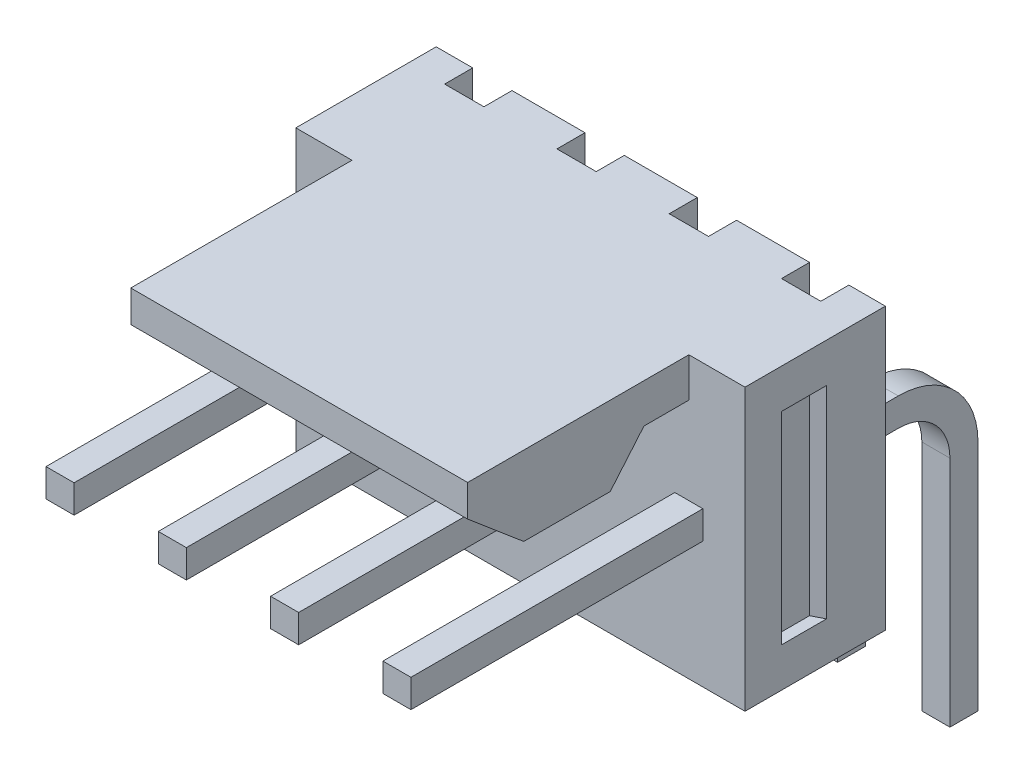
ISO-10303-21;
HEADER;
FILE_DESCRIPTION(('STEP AP214'),'2;1');
FILE_NAME('part.step','',(''),(''),'','','');
FILE_SCHEMA(('AUTOMOTIVE_DESIGN { 1 0 10303 214 1 1 1 1 }'));
ENDSEC;
DATA;
#1=APPLICATION_CONTEXT('core data for automotive mechanical design processes');
#2=APPLICATION_PROTOCOL_DEFINITION('international standard','automotive_design',2000,#1);
#3=PRODUCT_CONTEXT('',#1,'mechanical');
#4=PRODUCT('Part','Part','',(#3));
#5=PRODUCT_RELATED_PRODUCT_CATEGORY('part','',(#4));
#6=PRODUCT_DEFINITION_FORMATION('','',#4);
#7=PRODUCT_DEFINITION_CONTEXT('part definition',#1,'design');
#8=PRODUCT_DEFINITION('design','',#6,#7);
#9=PRODUCT_DEFINITION_SHAPE('','',#8);
#10=(LENGTH_UNIT() NAMED_UNIT(*) SI_UNIT(.MILLI.,.METRE.));
#11=(NAMED_UNIT(*) PLANE_ANGLE_UNIT() SI_UNIT($,.RADIAN.));
#12=(NAMED_UNIT(*) SI_UNIT($,.STERADIAN.) SOLID_ANGLE_UNIT());
#13=UNCERTAINTY_MEASURE_WITH_UNIT(LENGTH_MEASURE(1.E-05),#10,'distance_accuracy_value','');
#14=(GEOMETRIC_REPRESENTATION_CONTEXT(3) GLOBAL_UNCERTAINTY_ASSIGNED_CONTEXT((#13)) GLOBAL_UNIT_ASSIGNED_CONTEXT((#10,
#11,#12)) REPRESENTATION_CONTEXT('',''));
#15=CARTESIAN_POINT('',(0.,0.,0.));
#16=DIRECTION('',(0.,0.,1.));
#17=DIRECTION('',(1.,0.,0.));
#18=AXIS2_PLACEMENT_3D('',#15,#16,#17);
#19=CARTESIAN_POINT('',(2.2225,1.6891,1.4859));
#20=DIRECTION('',(1.,0.,0.));
#21=DIRECTION('',(0.,1.,0.));
#22=AXIS2_PLACEMENT_3D('',#19,#20,#21);
#23=CYLINDRICAL_SURFACE('',#22,1.1684);
#24=CARTESIAN_POINT('',(2.8575,1.6891,1.4859));
#25=DIRECTION('',(1.,0.,0.));
#26=DIRECTION('',(0.,1.,0.));
#27=AXIS2_PLACEMENT_3D('',#24,#25,#26);
#28=CIRCLE('',#27,1.1684);
#29=CARTESIAN_POINT('',(2.8575,2.8575,1.4859));
#30=VERTEX_POINT('',#29);
#31=CARTESIAN_POINT('',(2.8575,1.6891,0.317499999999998));
#32=VERTEX_POINT('',#31);
#33=EDGE_CURVE('E888',#30,#32,#28,.F.);
#34=ORIENTED_EDGE('',*,*,#33,.F.);
#35=DIRECTION('',(1.,0.,0.));
#36=VECTOR('',#35,1.);
#37=CARTESIAN_POINT('',(2.2225,2.8575,1.4859));
#38=LINE('',#37,#36);
#39=CARTESIAN_POINT('',(2.2225,2.8575,1.4859));
#40=VERTEX_POINT('',#39);
#41=EDGE_CURVE('E271',#40,#30,#38,.T.);
#42=ORIENTED_EDGE('',*,*,#41,.F.);
#43=CARTESIAN_POINT('',(2.2225,1.6891,1.4859));
#44=DIRECTION('',(1.,0.,0.));
#45=DIRECTION('',(0.,1.,0.));
#46=AXIS2_PLACEMENT_3D('',#43,#44,#45);
#47=CIRCLE('',#46,1.1684);
#48=CARTESIAN_POINT('',(2.2225,1.6891,0.317499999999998));
#49=VERTEX_POINT('',#48);
#50=EDGE_CURVE('E18',#40,#49,#47,.F.);
#51=ORIENTED_EDGE('',*,*,#50,.T.);
#52=DIRECTION('',(1.,0.,0.));
#53=VECTOR('',#52,1.);
#54=CARTESIAN_POINT('',(2.2225,1.6891,0.317499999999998));
#55=LINE('',#54,#53);
#56=EDGE_CURVE('E842',#32,#49,#55,.F.);
#57=ORIENTED_EDGE('',*,*,#56,.F.);
#58=EDGE_LOOP('',(#34,#42,#51,#57));
#59=FACE_BOUND('',#58,.T.);
#60=ADVANCED_FACE('F14',(#59),#23,.F.);
#61=CARTESIAN_POINT('',(2.2225,1.6891,0.317499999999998));
#62=DIRECTION('',(0.,0.,1.));
#63=DIRECTION('',(0.,-1.,0.));
#64=AXIS2_PLACEMENT_3D('',#61,#62,#63);
#65=PLANE('',#64);
#66=ORIENTED_EDGE('',*,*,#56,.T.);
#67=DIRECTION('',(0.,1.,0.));
#68=VECTOR('',#67,1.);
#69=CARTESIAN_POINT('',(2.2225,0.,0.317499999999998));
#70=LINE('',#69,#68);
#71=CARTESIAN_POINT('',(2.2225,-3.5814,0.317500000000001));
#72=VERTEX_POINT('',#71);
#73=EDGE_CURVE('E851',#49,#72,#70,.F.);
#74=ORIENTED_EDGE('',*,*,#73,.T.);
#75=DIRECTION('',(1.,0.,0.));
#76=VECTOR('',#75,1.);
#77=CARTESIAN_POINT('',(2.2225,-3.5814,0.3175));
#78=LINE('',#77,#76);
#79=CARTESIAN_POINT('',(2.8575,-3.5814,0.317500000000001));
#80=VERTEX_POINT('',#79);
#81=EDGE_CURVE('E830',#80,#72,#78,.F.);
#82=ORIENTED_EDGE('',*,*,#81,.F.);
#83=DIRECTION('',(0.,1.,0.));
#84=VECTOR('',#83,1.);
#85=CARTESIAN_POINT('',(2.8575,0.,0.317499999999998));
#86=LINE('',#85,#84);
#87=EDGE_CURVE('E837',#32,#80,#86,.F.);
#88=ORIENTED_EDGE('',*,*,#87,.F.);
#89=EDGE_LOOP('',(#66,#74,#82,#88));
#90=FACE_BOUND('',#89,.T.);
#91=ADVANCED_FACE('F2156',(#90),#65,.T.);
#92=CARTESIAN_POINT('',(2.2225,-3.5814,0.3175));
#93=DIRECTION('',(0.,-1.,0.));
#94=DIRECTION('',(1.,0.,0.));
#95=AXIS2_PLACEMENT_3D('',#92,#93,#94);
#96=PLANE('',#95);
#97=ORIENTED_EDGE('',*,*,#81,.T.);
#98=DIRECTION('',(0.,0.,1.));
#99=VECTOR('',#98,1.);
#100=CARTESIAN_POINT('',(2.2225,-3.5814,3.3655));
#101=LINE('',#100,#99);
#102=CARTESIAN_POINT('',(2.2225,-3.5814,-0.317499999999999));
#103=VERTEX_POINT('',#102);
#104=EDGE_CURVE('E848',#72,#103,#101,.F.);
#105=ORIENTED_EDGE('',*,*,#104,.T.);
#106=DIRECTION('',(1.,0.,0.));
#107=VECTOR('',#106,1.);
#108=CARTESIAN_POINT('',(2.2225,-3.5814,-0.3175));
#109=LINE('',#108,#107);
#110=CARTESIAN_POINT('',(2.8575,-3.5814,-0.317499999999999));
#111=VERTEX_POINT('',#110);
#112=EDGE_CURVE('E827',#111,#103,#109,.F.);
#113=ORIENTED_EDGE('',*,*,#112,.F.);
#114=DIRECTION('',(0.,0.,1.));
#115=VECTOR('',#114,1.);
#116=CARTESIAN_POINT('',(2.8575,-3.5814,3.3655));
#117=LINE('',#116,#115);
#118=EDGE_CURVE('E833',#80,#111,#117,.F.);
#119=ORIENTED_EDGE('',*,*,#118,.F.);
#120=EDGE_LOOP('',(#97,#105,#113,#119));
#121=FACE_BOUND('',#120,.T.);
#122=ADVANCED_FACE('F2149',(#121),#96,.T.);
#123=CARTESIAN_POINT('',(2.2225,-3.5814,-0.3175));
#124=DIRECTION('',(0.,0.,-1.));
#125=DIRECTION('',(0.,1.,0.));
#126=AXIS2_PLACEMENT_3D('',#123,#124,#125);
#127=PLANE('',#126);
#128=ORIENTED_EDGE('',*,*,#112,.T.);
#129=DIRECTION('',(0.,1.,0.));
#130=VECTOR('',#129,1.);
#131=CARTESIAN_POINT('',(2.2225,0.,-0.317500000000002));
#132=LINE('',#131,#130);
#133=CARTESIAN_POINT('',(2.2225,1.6891,-0.317500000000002));
#134=VERTEX_POINT('',#133);
#135=EDGE_CURVE('E850',#103,#134,#132,.T.);
#136=ORIENTED_EDGE('',*,*,#135,.T.);
#137=DIRECTION('',(1.,0.,0.));
#138=VECTOR('',#137,1.);
#139=CARTESIAN_POINT('',(2.2225,1.6891,-0.317500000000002));
#140=LINE('',#139,#138);
#141=CARTESIAN_POINT('',(2.8575,1.6891,-0.317500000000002));
#142=VERTEX_POINT('',#141);
#143=EDGE_CURVE('E821',#142,#134,#140,.F.);
#144=ORIENTED_EDGE('',*,*,#143,.F.);
#145=DIRECTION('',(0.,1.,0.));
#146=VECTOR('',#145,1.);
#147=CARTESIAN_POINT('',(2.8575,0.,-0.317500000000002));
#148=LINE('',#147,#146);
#149=EDGE_CURVE('E836',#111,#142,#148,.T.);
#150=ORIENTED_EDGE('',*,*,#149,.F.);
#151=EDGE_LOOP('',(#128,#136,#144,#150));
#152=FACE_BOUND('',#151,.T.);
#153=ADVANCED_FACE('F2142',(#152),#127,.T.);
#154=CARTESIAN_POINT('',(2.2225,1.6891,1.4859));
#155=DIRECTION('',(1.,0.,0.));
#156=DIRECTION('',(0.,1.,0.));
#157=AXIS2_PLACEMENT_3D('',#154,#155,#156);
#158=CYLINDRICAL_SURFACE('',#157,1.8034);
#159=ORIENTED_EDGE('',*,*,#143,.T.);
#160=CARTESIAN_POINT('',(2.2225,1.6891,1.4859));
#161=DIRECTION('',(1.,0.,0.));
#162=DIRECTION('',(0.,1.,0.));
#163=AXIS2_PLACEMENT_3D('',#160,#161,#162);
#164=CIRCLE('',#163,1.8034);
#165=CARTESIAN_POINT('',(2.2225,3.4925,1.4859));
#166=VERTEX_POINT('',#165);
#167=EDGE_CURVE('E891',#134,#166,#164,.T.);
#168=ORIENTED_EDGE('',*,*,#167,.T.);
#169=DIRECTION('',(-1.,0.,0.));
#170=VECTOR('',#169,1.);
#171=CARTESIAN_POINT('',(2.2225,3.4925,1.4859));
#172=LINE('',#171,#170);
#173=CARTESIAN_POINT('',(2.8575,3.4925,1.4859));
#174=VERTEX_POINT('',#173);
#175=EDGE_CURVE('E818',#174,#166,#172,.T.);
#176=ORIENTED_EDGE('',*,*,#175,.F.);
#177=CARTESIAN_POINT('',(2.8575,1.6891,1.4859));
#178=DIRECTION('',(1.,0.,0.));
#179=DIRECTION('',(0.,1.,0.));
#180=AXIS2_PLACEMENT_3D('',#177,#178,#179);
#181=CIRCLE('',#180,1.8034);
#182=EDGE_CURVE('E885',#142,#174,#181,.T.);
#183=ORIENTED_EDGE('',*,*,#182,.F.);
#184=EDGE_LOOP('',(#159,#168,#176,#183));
#185=FACE_BOUND('',#184,.T.);
#186=ADVANCED_FACE('F2134',(#185),#158,.T.);
#187=CARTESIAN_POINT('',(2.2225,3.4925,1.4859));
#188=DIRECTION('',(0.,1.,0.));
#189=DIRECTION('',(-1.,0.,0.));
#190=AXIS2_PLACEMENT_3D('',#187,#188,#189);
#191=PLANE('',#190);
#192=DIRECTION('',(0.,0.,1.));
#193=VECTOR('',#192,1.);
#194=CARTESIAN_POINT('',(2.2225,3.4925,3.3655));
#195=LINE('',#194,#193);
#196=CARTESIAN_POINT('',(2.2225,3.4925,3.3655));
#197=VERTEX_POINT('',#196);
#198=EDGE_CURVE('E890',#166,#197,#195,.T.);
#199=ORIENTED_EDGE('',*,*,#198,.T.);
#200=DIRECTION('',(-1.,0.,0.));
#201=VECTOR('',#200,1.);
#202=CARTESIAN_POINT('',(2.2225,3.4925,3.3655));
#203=LINE('',#202,#201);
#204=CARTESIAN_POINT('',(2.8575,3.4925,3.3655));
#205=VERTEX_POINT('',#204);
#206=EDGE_CURVE('E811',#197,#205,#203,.F.);
#207=ORIENTED_EDGE('',*,*,#206,.T.);
#208=DIRECTION('',(0.,0.,1.));
#209=VECTOR('',#208,1.);
#210=CARTESIAN_POINT('',(2.8575,3.4925,3.3655));
#211=LINE('',#210,#209);
#212=EDGE_CURVE('E760',#174,#205,#211,.T.);
#213=ORIENTED_EDGE('',*,*,#212,.F.);
#214=ORIENTED_EDGE('',*,*,#175,.T.);
#215=EDGE_LOOP('',(#199,#207,#213,#214));
#216=FACE_BOUND('',#215,.T.);
#217=ADVANCED_FACE('F2126',(#216),#191,.T.);
#218=CARTESIAN_POINT('',(4.7625,1.6891,1.4859));
#219=DIRECTION('',(1.,0.,0.));
#220=DIRECTION('',(0.,1.,0.));
#221=AXIS2_PLACEMENT_3D('',#218,#219,#220);
#222=CYLINDRICAL_SURFACE('',#221,1.1684);
#223=CARTESIAN_POINT('',(5.3975,1.6891,1.4859));
#224=DIRECTION('',(1.,0.,0.));
#225=DIRECTION('',(0.,1.,0.));
#226=AXIS2_PLACEMENT_3D('',#223,#224,#225);
#227=CIRCLE('',#226,1.1684);
#228=CARTESIAN_POINT('',(5.3975,2.8575,1.4859));
#229=VERTEX_POINT('',#228);
#230=CARTESIAN_POINT('',(5.3975,1.6891,0.317499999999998));
#231=VERTEX_POINT('',#230);
#232=EDGE_CURVE('E878',#229,#231,#227,.F.);
#233=ORIENTED_EDGE('',*,*,#232,.F.);
#234=DIRECTION('',(1.,0.,0.));
#235=VECTOR('',#234,1.);
#236=CARTESIAN_POINT('',(4.7625,2.8575,1.4859));
#237=LINE('',#236,#235);
#238=CARTESIAN_POINT('',(4.7625,2.8575,1.4859));
#239=VERTEX_POINT('',#238);
#240=EDGE_CURVE('E809',#239,#229,#237,.T.);
#241=ORIENTED_EDGE('',*,*,#240,.F.);
#242=CARTESIAN_POINT('',(4.7625,1.6891,1.4859));
#243=DIRECTION('',(1.,0.,0.));
#244=DIRECTION('',(0.,1.,0.));
#245=AXIS2_PLACEMENT_3D('',#242,#243,#244);
#246=CIRCLE('',#245,1.1684);
#247=CARTESIAN_POINT('',(4.7625,1.6891,0.317499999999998));
#248=VERTEX_POINT('',#247);
#249=EDGE_CURVE('E747',#239,#248,#246,.F.);
#250=ORIENTED_EDGE('',*,*,#249,.T.);
#251=DIRECTION('',(1.,0.,0.));
#252=VECTOR('',#251,1.);
#253=CARTESIAN_POINT('',(4.7625,1.6891,0.317499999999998));
#254=LINE('',#253,#252);
#255=EDGE_CURVE('E804',#231,#248,#254,.F.);
#256=ORIENTED_EDGE('',*,*,#255,.F.);
#257=EDGE_LOOP('',(#233,#241,#250,#256));
#258=FACE_BOUND('',#257,.T.);
#259=ADVANCED_FACE('F2118',(#258),#222,.F.);
#260=CARTESIAN_POINT('',(4.7625,1.6891,0.317499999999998));
#261=DIRECTION('',(0.,0.,1.));
#262=DIRECTION('',(0.,-1.,0.));
#263=AXIS2_PLACEMENT_3D('',#260,#261,#262);
#264=PLANE('',#263);
#265=ORIENTED_EDGE('',*,*,#255,.T.);
#266=DIRECTION('',(0.,1.,0.));
#267=VECTOR('',#266,1.);
#268=CARTESIAN_POINT('',(4.7625,0.,0.317499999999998));
#269=LINE('',#268,#267);
#270=CARTESIAN_POINT('',(4.7625,-3.5814,0.317500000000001));
#271=VERTEX_POINT('',#270);
#272=EDGE_CURVE('E815',#248,#271,#269,.F.);
#273=ORIENTED_EDGE('',*,*,#272,.T.);
#274=DIRECTION('',(1.,0.,0.));
#275=VECTOR('',#274,1.);
#276=CARTESIAN_POINT('',(4.7625,-3.5814,0.3175));
#277=LINE('',#276,#275);
#278=CARTESIAN_POINT('',(5.3975,-3.5814,0.317500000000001));
#279=VERTEX_POINT('',#278);
#280=EDGE_CURVE('E792',#279,#271,#277,.F.);
#281=ORIENTED_EDGE('',*,*,#280,.F.);
#282=DIRECTION('',(0.,1.,0.));
#283=VECTOR('',#282,1.);
#284=CARTESIAN_POINT('',(5.3975,0.,0.317499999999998));
#285=LINE('',#284,#283);
#286=EDGE_CURVE('E799',#231,#279,#285,.F.);
#287=ORIENTED_EDGE('',*,*,#286,.F.);
#288=EDGE_LOOP('',(#265,#273,#281,#287));
#289=FACE_BOUND('',#288,.T.);
#290=ADVANCED_FACE('F2110',(#289),#264,.T.);
#291=CARTESIAN_POINT('',(4.7625,-3.5814,0.3175));
#292=DIRECTION('',(0.,-1.,0.));
#293=DIRECTION('',(1.,0.,0.));
#294=AXIS2_PLACEMENT_3D('',#291,#292,#293);
#295=PLANE('',#294);
#296=ORIENTED_EDGE('',*,*,#280,.T.);
#297=DIRECTION('',(0.,0.,1.));
#298=VECTOR('',#297,1.);
#299=CARTESIAN_POINT('',(4.7625,-3.5814,3.3655));
#300=LINE('',#299,#298);
#301=CARTESIAN_POINT('',(4.7625,-3.5814,-0.317499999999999));
#302=VERTEX_POINT('',#301);
#303=EDGE_CURVE('E812',#271,#302,#300,.F.);
#304=ORIENTED_EDGE('',*,*,#303,.T.);
#305=DIRECTION('',(1.,0.,0.));
#306=VECTOR('',#305,1.);
#307=CARTESIAN_POINT('',(4.7625,-3.5814,-0.3175));
#308=LINE('',#307,#306);
#309=CARTESIAN_POINT('',(5.3975,-3.5814,-0.317499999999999));
#310=VERTEX_POINT('',#309);
#311=EDGE_CURVE('E789',#310,#302,#308,.F.);
#312=ORIENTED_EDGE('',*,*,#311,.F.);
#313=DIRECTION('',(0.,0.,1.));
#314=VECTOR('',#313,1.);
#315=CARTESIAN_POINT('',(5.3975,-3.5814,3.3655));
#316=LINE('',#315,#314);
#317=EDGE_CURVE('E795',#279,#310,#316,.F.);
#318=ORIENTED_EDGE('',*,*,#317,.F.);
#319=EDGE_LOOP('',(#296,#304,#312,#318));
#320=FACE_BOUND('',#319,.T.);
#321=ADVANCED_FACE('F2102',(#320),#295,.T.);
#322=CARTESIAN_POINT('',(4.7625,-3.5814,-0.3175));
#323=DIRECTION('',(0.,0.,-1.));
#324=DIRECTION('',(0.,1.,0.));
#325=AXIS2_PLACEMENT_3D('',#322,#323,#324);
#326=PLANE('',#325);
#327=ORIENTED_EDGE('',*,*,#311,.T.);
#328=DIRECTION('',(0.,1.,0.));
#329=VECTOR('',#328,1.);
#330=CARTESIAN_POINT('',(4.7625,0.,-0.317500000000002));
#331=LINE('',#330,#329);
#332=CARTESIAN_POINT('',(4.7625,1.6891,-0.317500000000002));
#333=VERTEX_POINT('',#332);
#334=EDGE_CURVE('E814',#302,#333,#331,.T.);
#335=ORIENTED_EDGE('',*,*,#334,.T.);
#336=DIRECTION('',(1.,0.,0.));
#337=VECTOR('',#336,1.);
#338=CARTESIAN_POINT('',(4.7625,1.6891,-0.317500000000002));
#339=LINE('',#338,#337);
#340=CARTESIAN_POINT('',(5.3975,1.6891,-0.317500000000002));
#341=VERTEX_POINT('',#340);
#342=EDGE_CURVE('E783',#341,#333,#339,.F.);
#343=ORIENTED_EDGE('',*,*,#342,.F.);
#344=DIRECTION('',(0.,1.,0.));
#345=VECTOR('',#344,1.);
#346=CARTESIAN_POINT('',(5.3975,0.,-0.317500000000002));
#347=LINE('',#346,#345);
#348=EDGE_CURVE('E798',#310,#341,#347,.T.);
#349=ORIENTED_EDGE('',*,*,#348,.F.);
#350=EDGE_LOOP('',(#327,#335,#343,#349));
#351=FACE_BOUND('',#350,.T.);
#352=ADVANCED_FACE('F2094',(#351),#326,.T.);
#353=CARTESIAN_POINT('',(4.7625,1.6891,1.4859));
#354=DIRECTION('',(1.,0.,0.));
#355=DIRECTION('',(0.,1.,0.));
#356=AXIS2_PLACEMENT_3D('',#353,#354,#355);
#357=CYLINDRICAL_SURFACE('',#356,1.8034);
#358=ORIENTED_EDGE('',*,*,#342,.T.);
#359=CARTESIAN_POINT('',(4.7625,1.6891,1.4859));
#360=DIRECTION('',(1.,0.,0.));
#361=DIRECTION('',(0.,1.,0.));
#362=AXIS2_PLACEMENT_3D('',#359,#360,#361);
#363=CIRCLE('',#362,1.8034);
#364=CARTESIAN_POINT('',(4.7625,3.4925,1.4859));
#365=VERTEX_POINT('',#364);
#366=EDGE_CURVE('E882',#333,#365,#363,.T.);
#367=ORIENTED_EDGE('',*,*,#366,.T.);
#368=DIRECTION('',(-1.,0.,0.));
#369=VECTOR('',#368,1.);
#370=CARTESIAN_POINT('',(4.7625,3.4925,1.4859));
#371=LINE('',#370,#369);
#372=CARTESIAN_POINT('',(5.3975,3.4925,1.4859));
#373=VERTEX_POINT('',#372);
#374=EDGE_CURVE('E780',#373,#365,#371,.T.);
#375=ORIENTED_EDGE('',*,*,#374,.F.);
#376=CARTESIAN_POINT('',(5.3975,1.6891,1.4859));
#377=DIRECTION('',(1.,0.,0.));
#378=DIRECTION('',(0.,1.,0.));
#379=AXIS2_PLACEMENT_3D('',#376,#377,#378);
#380=CIRCLE('',#379,1.8034);
#381=EDGE_CURVE('E875',#341,#373,#380,.T.);
#382=ORIENTED_EDGE('',*,*,#381,.F.);
#383=EDGE_LOOP('',(#358,#367,#375,#382));
#384=FACE_BOUND('',#383,.T.);
#385=ADVANCED_FACE('F2086',(#384),#357,.T.);
#386=CARTESIAN_POINT('',(4.7625,3.4925,1.4859));
#387=DIRECTION('',(0.,1.,0.));
#388=DIRECTION('',(-1.,0.,0.));
#389=AXIS2_PLACEMENT_3D('',#386,#387,#388);
#390=PLANE('',#389);
#391=DIRECTION('',(0.,0.,1.));
#392=VECTOR('',#391,1.);
#393=CARTESIAN_POINT('',(4.7625,3.4925,3.3655));
#394=LINE('',#393,#392);
#395=CARTESIAN_POINT('',(4.7625,3.4925,3.3655));
#396=VERTEX_POINT('',#395);
#397=EDGE_CURVE('E881',#365,#396,#394,.T.);
#398=ORIENTED_EDGE('',*,*,#397,.T.);
#399=DIRECTION('',(-1.,0.,0.));
#400=VECTOR('',#399,1.);
#401=CARTESIAN_POINT('',(4.7625,3.4925,3.3655));
#402=LINE('',#401,#400);
#403=CARTESIAN_POINT('',(5.3975,3.4925,3.3655));
#404=VERTEX_POINT('',#403);
#405=EDGE_CURVE('E777',#396,#404,#402,.F.);
#406=ORIENTED_EDGE('',*,*,#405,.T.);
#407=DIRECTION('',(0.,0.,1.));
#408=VECTOR('',#407,1.);
#409=CARTESIAN_POINT('',(5.3975,3.4925,3.3655));
#410=LINE('',#409,#408);
#411=EDGE_CURVE('E730',#373,#404,#410,.T.);
#412=ORIENTED_EDGE('',*,*,#411,.F.);
#413=ORIENTED_EDGE('',*,*,#374,.T.);
#414=EDGE_LOOP('',(#398,#406,#412,#413));
#415=FACE_BOUND('',#414,.T.);
#416=ADVANCED_FACE('F2078',(#415),#390,.T.);
#417=CARTESIAN_POINT('',(2.2225,0.,3.3655));
#418=DIRECTION('',(1.,0.,0.));
#419=DIRECTION('',(0.,1.,0.));
#420=AXIS2_PLACEMENT_3D('',#417,#418,#419);
#421=PLANE('',#420);
#422=ORIENTED_EDGE('',*,*,#167,.F.);
#423=ORIENTED_EDGE('',*,*,#135,.F.);
#424=ORIENTED_EDGE('',*,*,#104,.F.);
#425=ORIENTED_EDGE('',*,*,#73,.F.);
#426=ORIENTED_EDGE('',*,*,#50,.F.);
#427=DIRECTION('',(0.,0.,1.));
#428=VECTOR('',#427,1.);
#429=CARTESIAN_POINT('',(2.2225,2.8575,3.3655));
#430=LINE('',#429,#428);
#431=CARTESIAN_POINT('',(2.2225,2.8575,3.3655));
#432=VERTEX_POINT('',#431);
#433=EDGE_CURVE('E754',#432,#40,#430,.F.);
#434=ORIENTED_EDGE('',*,*,#433,.F.);
#435=DIRECTION('',(0.,1.,0.));
#436=VECTOR('',#435,1.);
#437=CARTESIAN_POINT('',(2.2225,0.,3.3655));
#438=LINE('',#437,#436);
#439=EDGE_CURVE('E775',#197,#432,#438,.F.);
#440=ORIENTED_EDGE('',*,*,#439,.F.);
#441=ORIENTED_EDGE('',*,*,#198,.F.);
#442=EDGE_LOOP('',(#422,#423,#424,#425,#426,#434,#440,#441));
#443=FACE_BOUND('',#442,.T.);
#444=ADVANCED_FACE('F2070',(#443),#421,.F.);
#445=CARTESIAN_POINT('',(2.8575,0.,3.3655));
#446=DIRECTION('',(1.,0.,0.));
#447=DIRECTION('',(0.,1.,0.));
#448=AXIS2_PLACEMENT_3D('',#445,#446,#447);
#449=PLANE('',#448);
#450=ORIENTED_EDGE('',*,*,#212,.T.);
#451=DIRECTION('',(0.,1.,0.));
#452=VECTOR('',#451,1.);
#453=CARTESIAN_POINT('',(2.8575,0.,3.3655));
#454=LINE('',#453,#452);
#455=CARTESIAN_POINT('',(2.8575,2.8575,3.3655));
#456=VERTEX_POINT('',#455);
#457=EDGE_CURVE('E757',#205,#456,#454,.F.);
#458=ORIENTED_EDGE('',*,*,#457,.T.);
#459=DIRECTION('',(0.,0.,1.));
#460=VECTOR('',#459,1.);
#461=CARTESIAN_POINT('',(2.8575,2.8575,3.3655));
#462=LINE('',#461,#460);
#463=EDGE_CURVE('E750',#30,#456,#462,.T.);
#464=ORIENTED_EDGE('',*,*,#463,.F.);
#465=ORIENTED_EDGE('',*,*,#33,.T.);
#466=ORIENTED_EDGE('',*,*,#87,.T.);
#467=ORIENTED_EDGE('',*,*,#118,.T.);
#468=ORIENTED_EDGE('',*,*,#149,.T.);
#469=ORIENTED_EDGE('',*,*,#182,.T.);
#470=EDGE_LOOP('',(#450,#458,#464,#465,#466,#467,#468,#469));
#471=FACE_BOUND('',#470,.T.);
#472=ADVANCED_FACE('F2063',(#471),#449,.T.);
#473=CARTESIAN_POINT('',(-1.27,0.,2.7305));
#474=DIRECTION('',(0.,0.,-1.));
#475=DIRECTION('',(0.,1.,0.));
#476=AXIS2_PLACEMENT_3D('',#473,#474,#475);
#477=PLANE('',#476);
#478=DIRECTION('',(1.,0.,0.));
#479=VECTOR('',#478,1.);
#480=CARTESIAN_POINT('',(-1.27,6.35,2.73049999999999));
#481=LINE('',#480,#479);
#482=CARTESIAN_POINT('',(2.9845,6.35,2.73049999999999));
#483=VERTEX_POINT('',#482);
#484=CARTESIAN_POINT('',(4.6355,6.35,2.73049999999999));
#485=VERTEX_POINT('',#484);
#486=EDGE_CURVE('E279',#483,#485,#481,.T.);
#487=ORIENTED_EDGE('',*,*,#486,.T.);
#488=DIRECTION('',(0.,-1.,0.));
#489=VECTOR('',#488,1.);
#490=CARTESIAN_POINT('',(4.6355,0.,2.7305));
#491=LINE('',#490,#489);
#492=CARTESIAN_POINT('',(4.6355,0.,2.7305));
#493=VERTEX_POINT('',#492);
#494=EDGE_CURVE('E753',#485,#493,#491,.T.);
#495=ORIENTED_EDGE('',*,*,#494,.T.);
#496=DIRECTION('',(1.,0.,0.));
#497=VECTOR('',#496,1.);
#498=CARTESIAN_POINT('',(-1.27,0.,2.7305));
#499=LINE('',#498,#497);
#500=CARTESIAN_POINT('',(2.9845,0.,2.7305));
#501=VERTEX_POINT('',#500);
#502=EDGE_CURVE('E759',#493,#501,#499,.F.);
#503=ORIENTED_EDGE('',*,*,#502,.T.);
#504=DIRECTION('',(0.,1.,0.));
#505=VECTOR('',#504,1.);
#506=CARTESIAN_POINT('',(2.9845,0.,2.7305));
#507=LINE('',#506,#505);
#508=EDGE_CURVE('E729',#501,#483,#507,.T.);
#509=ORIENTED_EDGE('',*,*,#508,.T.);
#510=EDGE_LOOP('',(#487,#495,#503,#509));
#511=FACE_BOUND('',#510,.T.);
#512=ADVANCED_FACE('F1610',(#511),#477,.T.);
#513=CARTESIAN_POINT('',(4.7625,0.,3.3655));
#514=DIRECTION('',(1.,0.,0.));
#515=DIRECTION('',(0.,1.,0.));
#516=AXIS2_PLACEMENT_3D('',#513,#514,#515);
#517=PLANE('',#516);
#518=ORIENTED_EDGE('',*,*,#366,.F.);
#519=ORIENTED_EDGE('',*,*,#334,.F.);
#520=ORIENTED_EDGE('',*,*,#303,.F.);
#521=ORIENTED_EDGE('',*,*,#272,.F.);
#522=ORIENTED_EDGE('',*,*,#249,.F.);
#523=DIRECTION('',(0.,0.,1.));
#524=VECTOR('',#523,1.);
#525=CARTESIAN_POINT('',(4.7625,2.8575,3.3655));
#526=LINE('',#525,#524);
#527=CARTESIAN_POINT('',(4.7625,2.8575,3.3655));
#528=VERTEX_POINT('',#527);
#529=EDGE_CURVE('E724',#528,#239,#526,.F.);
#530=ORIENTED_EDGE('',*,*,#529,.F.);
#531=DIRECTION('',(0.,1.,0.));
#532=VECTOR('',#531,1.);
#533=CARTESIAN_POINT('',(4.7625,0.,3.3655));
#534=LINE('',#533,#532);
#535=EDGE_CURVE('E745',#396,#528,#534,.F.);
#536=ORIENTED_EDGE('',*,*,#535,.F.);
#537=ORIENTED_EDGE('',*,*,#397,.F.);
#538=EDGE_LOOP('',(#518,#519,#520,#521,#522,#530,#536,#537));
#539=FACE_BOUND('',#538,.T.);
#540=ADVANCED_FACE('F2048',(#539),#517,.F.);
#541=CARTESIAN_POINT('',(5.3975,0.,3.3655));
#542=DIRECTION('',(1.,0.,0.));
#543=DIRECTION('',(0.,1.,0.));
#544=AXIS2_PLACEMENT_3D('',#541,#542,#543);
#545=PLANE('',#544);
#546=ORIENTED_EDGE('',*,*,#411,.T.);
#547=DIRECTION('',(0.,1.,0.));
#548=VECTOR('',#547,1.);
#549=CARTESIAN_POINT('',(5.3975,0.,3.3655));
#550=LINE('',#549,#548);
#551=CARTESIAN_POINT('',(5.3975,2.8575,3.3655));
#552=VERTEX_POINT('',#551);
#553=EDGE_CURVE('E727',#404,#552,#550,.F.);
#554=ORIENTED_EDGE('',*,*,#553,.T.);
#555=DIRECTION('',(0.,0.,1.));
#556=VECTOR('',#555,1.);
#557=CARTESIAN_POINT('',(5.3975,2.8575,3.3655));
#558=LINE('',#557,#556);
#559=EDGE_CURVE('E720',#229,#552,#558,.T.);
#560=ORIENTED_EDGE('',*,*,#559,.F.);
#561=ORIENTED_EDGE('',*,*,#232,.T.);
#562=ORIENTED_EDGE('',*,*,#286,.T.);
#563=ORIENTED_EDGE('',*,*,#317,.T.);
#564=ORIENTED_EDGE('',*,*,#348,.T.);
#565=ORIENTED_EDGE('',*,*,#381,.T.);
#566=EDGE_LOOP('',(#546,#554,#560,#561,#562,#563,#564,#565));
#567=FACE_BOUND('',#566,.T.);
#568=ADVANCED_FACE('F2042',(#567),#545,.T.);
#569=CARTESIAN_POINT('',(2.9845,0.,2.7305));
#570=DIRECTION('',(1.,0.,0.));
#571=DIRECTION('',(0.,1.,0.));
#572=AXIS2_PLACEMENT_3D('',#569,#570,#571);
#573=PLANE('',#572);
#574=DIRECTION('',(0.,-1.,0.));
#575=VECTOR('',#574,1.);
#576=CARTESIAN_POINT('',(2.9845,0.,3.3655));
#577=LINE('',#576,#575);
#578=CARTESIAN_POINT('',(2.9845,0.,3.3655));
#579=VERTEX_POINT('',#578);
#580=CARTESIAN_POINT('',(2.9845,6.35,3.36549999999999));
#581=VERTEX_POINT('',#580);
#582=EDGE_CURVE('E767',#579,#581,#577,.F.);
#583=ORIENTED_EDGE('',*,*,#582,.T.);
#584=DIRECTION('',(0.,0.,1.));
#585=VECTOR('',#584,1.);
#586=CARTESIAN_POINT('',(2.9845,6.35,2.73049999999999));
#587=LINE('',#586,#585);
#588=EDGE_CURVE('E945',#483,#581,#587,.T.);
#589=ORIENTED_EDGE('',*,*,#588,.F.);
#590=ORIENTED_EDGE('',*,*,#508,.F.);
#591=DIRECTION('',(0.,0.,1.));
#592=VECTOR('',#591,1.);
#593=CARTESIAN_POINT('',(2.9845,0.,2.7305));
#594=LINE('',#593,#592);
#595=EDGE_CURVE('E772',#579,#501,#594,.F.);
#596=ORIENTED_EDGE('',*,*,#595,.F.);
#597=EDGE_LOOP('',(#583,#589,#590,#596));
#598=FACE_BOUND('',#597,.T.);
#599=ADVANCED_FACE('F1607',(#598),#573,.F.);
#600=CARTESIAN_POINT('',(2.2225,2.8575,3.3655));
#601=DIRECTION('',(0.,-1.,0.));
#602=DIRECTION('',(1.,0.,0.));
#603=AXIS2_PLACEMENT_3D('',#600,#601,#602);
#604=PLANE('',#603);
#605=ORIENTED_EDGE('',*,*,#463,.T.);
#606=DIRECTION('',(1.,0.,0.));
#607=VECTOR('',#606,1.);
#608=CARTESIAN_POINT('',(2.9845,2.8575,3.3655));
#609=LINE('',#608,#607);
#610=EDGE_CURVE('E763',#456,#432,#609,.F.);
#611=ORIENTED_EDGE('',*,*,#610,.T.);
#612=ORIENTED_EDGE('',*,*,#433,.T.);
#613=ORIENTED_EDGE('',*,*,#41,.T.);
#614=EDGE_LOOP('',(#605,#611,#612,#613));
#615=FACE_BOUND('',#614,.T.);
#616=ADVANCED_FACE('F1617',(#615),#604,.T.);
#617=CARTESIAN_POINT('',(4.6355,0.,3.3655));
#618=DIRECTION('',(-1.,0.,0.));
#619=DIRECTION('',(0.,-1.,0.));
#620=AXIS2_PLACEMENT_3D('',#617,#618,#619);
#621=PLANE('',#620);
#622=DIRECTION('',(0.,-1.,0.));
#623=VECTOR('',#622,1.);
#624=CARTESIAN_POINT('',(4.6355,0.,3.3655));
#625=LINE('',#624,#623);
#626=CARTESIAN_POINT('',(4.6355,6.35,3.36549999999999));
#627=VERTEX_POINT('',#626);
#628=CARTESIAN_POINT('',(4.6355,0.,3.3655));
#629=VERTEX_POINT('',#628);
#630=EDGE_CURVE('E959',#627,#629,#625,.T.);
#631=ORIENTED_EDGE('',*,*,#630,.T.);
#632=DIRECTION('',(0.,0.,1.));
#633=VECTOR('',#632,1.);
#634=CARTESIAN_POINT('',(4.6355,0.,3.3655));
#635=LINE('',#634,#633);
#636=EDGE_CURVE('E949',#493,#629,#635,.T.);
#637=ORIENTED_EDGE('',*,*,#636,.F.);
#638=ORIENTED_EDGE('',*,*,#494,.F.);
#639=DIRECTION('',(0.,0.,1.));
#640=VECTOR('',#639,1.);
#641=CARTESIAN_POINT('',(4.6355,6.35,3.36549999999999));
#642=LINE('',#641,#640);
#643=EDGE_CURVE('E742',#627,#485,#642,.F.);
#644=ORIENTED_EDGE('',*,*,#643,.F.);
#645=EDGE_LOOP('',(#631,#637,#638,#644));
#646=FACE_BOUND('',#645,.T.);
#647=ADVANCED_FACE('F1614',(#646),#621,.F.);
#648=CARTESIAN_POINT('',(4.7625,2.8575,3.3655));
#649=DIRECTION('',(0.,-1.,0.));
#650=DIRECTION('',(1.,0.,0.));
#651=AXIS2_PLACEMENT_3D('',#648,#649,#650);
#652=PLANE('',#651);
#653=ORIENTED_EDGE('',*,*,#559,.T.);
#654=DIRECTION('',(1.,0.,0.));
#655=VECTOR('',#654,1.);
#656=CARTESIAN_POINT('',(5.5245,2.8575,3.3655));
#657=LINE('',#656,#655);
#658=EDGE_CURVE('E733',#552,#528,#657,.F.);
#659=ORIENTED_EDGE('',*,*,#658,.T.);
#660=ORIENTED_EDGE('',*,*,#529,.T.);
#661=ORIENTED_EDGE('',*,*,#240,.T.);
#662=EDGE_LOOP('',(#653,#659,#660,#661));
#663=FACE_BOUND('',#662,.T.);
#664=ADVANCED_FACE('F1616',(#663),#652,.T.);
#665=CARTESIAN_POINT('',(2.9845,0.,3.3655));
#666=DIRECTION('',(0.,0.,1.));
#667=DIRECTION('',(0.,-1.,0.));
#668=AXIS2_PLACEMENT_3D('',#665,#666,#667);
#669=PLANE('',#668);
#670=ORIENTED_EDGE('',*,*,#457,.F.);
#671=ORIENTED_EDGE('',*,*,#206,.F.);
#672=ORIENTED_EDGE('',*,*,#439,.T.);
#673=ORIENTED_EDGE('',*,*,#610,.F.);
#674=EDGE_LOOP('',(#670,#671,#672,#673));
#675=FACE_BOUND('',#674,.T.);
#676=DIRECTION('',(1.,0.,0.));
#677=VECTOR('',#676,1.);
#678=CARTESIAN_POINT('',(2.9845,0.,3.3655));
#679=LINE('',#678,#677);
#680=CARTESIAN_POINT('',(2.0955,0.,3.3655));
#681=VERTEX_POINT('',#680);
#682=EDGE_CURVE('E955',#681,#579,#679,.T.);
#683=ORIENTED_EDGE('',*,*,#682,.F.);
#684=DIRECTION('',(0.,-1.,0.));
#685=VECTOR('',#684,1.);
#686=CARTESIAN_POINT('',(2.0955,0.,3.3655));
#687=LINE('',#686,#685);
#688=CARTESIAN_POINT('',(2.0955,6.35,3.36549999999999));
#689=VERTEX_POINT('',#688);
#690=EDGE_CURVE('E964',#681,#689,#687,.F.);
#691=ORIENTED_EDGE('',*,*,#690,.T.);
#692=DIRECTION('',(1.,0.,0.));
#693=VECTOR('',#692,1.);
#694=CARTESIAN_POINT('',(2.9845,6.35,3.36549999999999));
#695=LINE('',#694,#693);
#696=EDGE_CURVE('E723',#581,#689,#695,.F.);
#697=ORIENTED_EDGE('',*,*,#696,.F.);
#698=ORIENTED_EDGE('',*,*,#582,.F.);
#699=EDGE_LOOP('',(#683,#691,#697,#698));
#700=FACE_BOUND('',#699,.T.);
#701=ADVANCED_FACE('F1602',(#675,#700),#669,.F.);
#702=CARTESIAN_POINT('',(5.5245,0.,3.3655));
#703=DIRECTION('',(0.,0.,1.));
#704=DIRECTION('',(0.,-1.,0.));
#705=AXIS2_PLACEMENT_3D('',#702,#703,#704);
#706=PLANE('',#705);
#707=ORIENTED_EDGE('',*,*,#553,.F.);
#708=ORIENTED_EDGE('',*,*,#405,.F.);
#709=ORIENTED_EDGE('',*,*,#535,.T.);
#710=ORIENTED_EDGE('',*,*,#658,.F.);
#711=EDGE_LOOP('',(#707,#708,#709,#710));
#712=FACE_BOUND('',#711,.T.);
#713=DIRECTION('',(1.,0.,0.));
#714=VECTOR('',#713,1.);
#715=CARTESIAN_POINT('',(5.5245,0.,3.3655));
#716=LINE('',#715,#714);
#717=CARTESIAN_POINT('',(5.5245,0.,3.3655));
#718=VERTEX_POINT('',#717);
#719=EDGE_CURVE('E737',#629,#718,#716,.T.);
#720=ORIENTED_EDGE('',*,*,#719,.F.);
#721=ORIENTED_EDGE('',*,*,#630,.F.);
#722=DIRECTION('',(1.,0.,0.));
#723=VECTOR('',#722,1.);
#724=CARTESIAN_POINT('',(5.5245,6.35,3.36549999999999));
#725=LINE('',#724,#723);
#726=CARTESIAN_POINT('',(5.5245,6.35,3.36549999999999));
#727=VERTEX_POINT('',#726);
#728=EDGE_CURVE('E766',#727,#627,#725,.F.);
#729=ORIENTED_EDGE('',*,*,#728,.F.);
#730=DIRECTION('',(0.,1.,0.));
#731=VECTOR('',#730,1.);
#732=CARTESIAN_POINT('',(5.5245,0.,3.3655));
#733=LINE('',#732,#731);
#734=EDGE_CURVE('E969',#727,#718,#733,.F.);
#735=ORIENTED_EDGE('',*,*,#734,.T.);
#736=EDGE_LOOP('',(#720,#721,#729,#735));
#737=FACE_BOUND('',#736,.T.);
#738=ADVANCED_FACE('F1377',(#712,#737),#706,.F.);
#739=CARTESIAN_POINT('',(2.0955,0.,3.3655));
#740=DIRECTION('',(-1.,0.,0.));
#741=DIRECTION('',(0.,-1.,0.));
#742=AXIS2_PLACEMENT_3D('',#739,#740,#741);
#743=PLANE('',#742);
#744=ORIENTED_EDGE('',*,*,#690,.F.);
#745=DIRECTION('',(0.,0.,1.));
#746=VECTOR('',#745,1.);
#747=CARTESIAN_POINT('',(2.0955,0.,3.3655));
#748=LINE('',#747,#746);
#749=CARTESIAN_POINT('',(2.0955,0.,2.7305));
#750=VERTEX_POINT('',#749);
#751=EDGE_CURVE('E736',#750,#681,#748,.T.);
#752=ORIENTED_EDGE('',*,*,#751,.F.);
#753=DIRECTION('',(0.,1.,0.));
#754=VECTOR('',#753,1.);
#755=CARTESIAN_POINT('',(2.0955,0.,2.7305));
#756=LINE('',#755,#754);
#757=CARTESIAN_POINT('',(2.0955,6.35,2.73049999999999));
#758=VERTEX_POINT('',#757);
#759=EDGE_CURVE('E637',#758,#750,#756,.F.);
#760=ORIENTED_EDGE('',*,*,#759,.F.);
#761=DIRECTION('',(0.,0.,1.));
#762=VECTOR('',#761,1.);
#763=CARTESIAN_POINT('',(2.0955,6.35,3.36549999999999));
#764=LINE('',#763,#762);
#765=EDGE_CURVE('E710',#689,#758,#764,.F.);
#766=ORIENTED_EDGE('',*,*,#765,.F.);
#767=EDGE_LOOP('',(#744,#752,#760,#766));
#768=FACE_BOUND('',#767,.T.);
#769=ADVANCED_FACE('F1598',(#768),#743,.F.);
#770=CARTESIAN_POINT('',(-0.317500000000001,3.4925,1.4859));
#771=DIRECTION('',(0.,1.,0.));
#772=DIRECTION('',(-1.,0.,0.));
#773=AXIS2_PLACEMENT_3D('',#770,#771,#772);
#774=PLANE('',#773);
#775=DIRECTION('',(1.,0.,0.));
#776=VECTOR('',#775,1.);
#777=CARTESIAN_POINT('',(-0.317500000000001,3.4925,1.4859));
#778=LINE('',#777,#776);
#779=CARTESIAN_POINT('',(-0.317500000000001,3.4925,1.4859));
#780=VERTEX_POINT('',#779);
#781=CARTESIAN_POINT('',(0.317499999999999,3.4925,1.4859));
#782=VERTEX_POINT('',#781);
#783=EDGE_CURVE('E684',#780,#782,#778,.T.);
#784=ORIENTED_EDGE('',*,*,#783,.F.);
#785=DIRECTION('',(0.,0.,1.));
#786=VECTOR('',#785,1.);
#787=CARTESIAN_POINT('',(-0.317500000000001,3.4925,3.3655));
#788=LINE('',#787,#786);
#789=CARTESIAN_POINT('',(-0.317500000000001,3.4925,3.3655));
#790=VERTEX_POINT('',#789);
#791=EDGE_CURVE('E619',#780,#790,#788,.T.);
#792=ORIENTED_EDGE('',*,*,#791,.T.);
#793=DIRECTION('',(-1.,0.,0.));
#794=VECTOR('',#793,1.);
#795=CARTESIAN_POINT('',(-0.317500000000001,3.4925,3.3655));
#796=LINE('',#795,#794);
#797=CARTESIAN_POINT('',(0.317499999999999,3.4925,3.3655));
#798=VERTEX_POINT('',#797);
#799=EDGE_CURVE('E707',#790,#798,#796,.F.);
#800=ORIENTED_EDGE('',*,*,#799,.T.);
#801=DIRECTION('',(0.,0.,1.));
#802=VECTOR('',#801,1.);
#803=CARTESIAN_POINT('',(0.317499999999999,3.4925,3.3655));
#804=LINE('',#803,#802);
#805=EDGE_CURVE('E872',#782,#798,#804,.T.);
#806=ORIENTED_EDGE('',*,*,#805,.F.);
#807=EDGE_LOOP('',(#784,#792,#800,#806));
#808=FACE_BOUND('',#807,.T.);
#809=ADVANCED_FACE('F1637',(#808),#774,.T.);
#810=CARTESIAN_POINT('',(-0.317500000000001,1.6891,1.4859));
#811=DIRECTION('',(1.,0.,0.));
#812=DIRECTION('',(0.,1.,0.));
#813=AXIS2_PLACEMENT_3D('',#810,#811,#812);
#814=CYLINDRICAL_SURFACE('',#813,1.1684);
#815=CARTESIAN_POINT('',(0.317499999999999,1.6891,1.4859));
#816=DIRECTION('',(1.,0.,0.));
#817=DIRECTION('',(0.,1.,0.));
#818=AXIS2_PLACEMENT_3D('',#815,#816,#817);
#819=CIRCLE('',#818,1.1684);
#820=CARTESIAN_POINT('',(0.317499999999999,2.8575,1.4859));
#821=VERTEX_POINT('',#820);
#822=CARTESIAN_POINT('',(0.317499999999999,1.6891,0.317499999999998));
#823=VERTEX_POINT('',#822);
#824=EDGE_CURVE('E636',#821,#823,#819,.F.);
#825=ORIENTED_EDGE('',*,*,#824,.F.);
#826=DIRECTION('',(1.,0.,0.));
#827=VECTOR('',#826,1.);
#828=CARTESIAN_POINT('',(-0.317500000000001,2.8575,1.4859));
#829=LINE('',#828,#827);
#830=CARTESIAN_POINT('',(-0.317500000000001,2.8575,1.4859));
#831=VERTEX_POINT('',#830);
#832=EDGE_CURVE('E705',#831,#821,#829,.T.);
#833=ORIENTED_EDGE('',*,*,#832,.F.);
#834=CARTESIAN_POINT('',(-0.317500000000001,1.6891,1.4859));
#835=DIRECTION('',(1.,0.,0.));
#836=DIRECTION('',(0.,1.,0.));
#837=AXIS2_PLACEMENT_3D('',#834,#835,#836);
#838=CIRCLE('',#837,1.1684);
#839=CARTESIAN_POINT('',(-0.317500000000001,1.6891,0.317499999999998));
#840=VERTEX_POINT('',#839);
#841=EDGE_CURVE('E618',#831,#840,#838,.F.);
#842=ORIENTED_EDGE('',*,*,#841,.T.);
#843=DIRECTION('',(1.,0.,0.));
#844=VECTOR('',#843,1.);
#845=CARTESIAN_POINT('',(-0.317500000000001,1.6891,0.317499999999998));
#846=LINE('',#845,#844);
#847=EDGE_CURVE('E700',#823,#840,#846,.F.);
#848=ORIENTED_EDGE('',*,*,#847,.F.);
#849=EDGE_LOOP('',(#825,#833,#842,#848));
#850=FACE_BOUND('',#849,.T.);
#851=ADVANCED_FACE('F1640',(#850),#814,.F.);
#852=CARTESIAN_POINT('',(-0.317500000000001,1.6891,0.317499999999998));
#853=DIRECTION('',(0.,0.,1.));
#854=DIRECTION('',(0.,-1.,0.));
#855=AXIS2_PLACEMENT_3D('',#852,#853,#854);
#856=PLANE('',#855);
#857=ORIENTED_EDGE('',*,*,#847,.T.);
#858=DIRECTION('',(0.,1.,0.));
#859=VECTOR('',#858,1.);
#860=CARTESIAN_POINT('',(-0.317500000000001,0.,0.317499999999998));
#861=LINE('',#860,#859);
#862=CARTESIAN_POINT('',(-0.317500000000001,-3.5814,0.317500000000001));
#863=VERTEX_POINT('',#862);
#864=EDGE_CURVE('E695',#840,#863,#861,.F.);
#865=ORIENTED_EDGE('',*,*,#864,.T.);
#866=DIRECTION('',(1.,0.,0.));
#867=VECTOR('',#866,1.);
#868=CARTESIAN_POINT('',(-0.317500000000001,-3.5814,0.3175));
#869=LINE('',#868,#867);
#870=CARTESIAN_POINT('',(0.317499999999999,-3.5814,0.317500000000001));
#871=VERTEX_POINT('',#870);
#872=EDGE_CURVE('E689',#871,#863,#869,.F.);
#873=ORIENTED_EDGE('',*,*,#872,.F.);
#874=DIRECTION('',(0.,1.,0.));
#875=VECTOR('',#874,1.);
#876=CARTESIAN_POINT('',(0.317499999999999,0.,0.317499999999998));
#877=LINE('',#876,#875);
#878=EDGE_CURVE('E717',#823,#871,#877,.F.);
#879=ORIENTED_EDGE('',*,*,#878,.F.);
#880=EDGE_LOOP('',(#857,#865,#873,#879));
#881=FACE_BOUND('',#880,.T.);
#882=ADVANCED_FACE('F1644',(#881),#856,.T.);
#883=CARTESIAN_POINT('',(-0.317500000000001,-3.5814,0.3175));
#884=DIRECTION('',(0.,-1.,0.));
#885=DIRECTION('',(1.,0.,0.));
#886=AXIS2_PLACEMENT_3D('',#883,#884,#885);
#887=PLANE('',#886);
#888=ORIENTED_EDGE('',*,*,#872,.T.);
#889=DIRECTION('',(0.,0.,1.));
#890=VECTOR('',#889,1.);
#891=CARTESIAN_POINT('',(-0.317500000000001,-3.5814,3.3655));
#892=LINE('',#891,#890);
#893=CARTESIAN_POINT('',(-0.317500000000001,-3.5814,-0.317499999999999));
#894=VERTEX_POINT('',#893);
#895=EDGE_CURVE('E692',#863,#894,#892,.F.);
#896=ORIENTED_EDGE('',*,*,#895,.T.);
#897=DIRECTION('',(1.,0.,0.));
#898=VECTOR('',#897,1.);
#899=CARTESIAN_POINT('',(-0.317500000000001,-3.5814,-0.3175));
#900=LINE('',#899,#898);
#901=CARTESIAN_POINT('',(0.317499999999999,-3.5814,-0.317499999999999));
#902=VERTEX_POINT('',#901);
#903=EDGE_CURVE('E686',#902,#894,#900,.F.);
#904=ORIENTED_EDGE('',*,*,#903,.F.);
#905=DIRECTION('',(0.,0.,1.));
#906=VECTOR('',#905,1.);
#907=CARTESIAN_POINT('',(0.317499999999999,-3.5814,3.3655));
#908=LINE('',#907,#906);
#909=EDGE_CURVE('E713',#871,#902,#908,.F.);
#910=ORIENTED_EDGE('',*,*,#909,.F.);
#911=EDGE_LOOP('',(#888,#896,#904,#910));
#912=FACE_BOUND('',#911,.T.);
#913=ADVANCED_FACE('F1648',(#912),#887,.T.);
#914=CARTESIAN_POINT('',(-0.317500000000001,-3.5814,-0.3175));
#915=DIRECTION('',(0.,0.,-1.));
#916=DIRECTION('',(0.,1.,0.));
#917=AXIS2_PLACEMENT_3D('',#914,#915,#916);
#918=PLANE('',#917);
#919=ORIENTED_EDGE('',*,*,#903,.T.);
#920=DIRECTION('',(0.,1.,0.));
#921=VECTOR('',#920,1.);
#922=CARTESIAN_POINT('',(-0.317500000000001,0.,-0.317500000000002));
#923=LINE('',#922,#921);
#924=CARTESIAN_POINT('',(-0.317500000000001,1.6891,-0.317500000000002));
#925=VERTEX_POINT('',#924);
#926=EDGE_CURVE('E694',#894,#925,#923,.T.);
#927=ORIENTED_EDGE('',*,*,#926,.T.);
#928=DIRECTION('',(1.,0.,0.));
#929=VECTOR('',#928,1.);
#930=CARTESIAN_POINT('',(-0.317500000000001,1.6891,-0.317500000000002));
#931=LINE('',#930,#929);
#932=CARTESIAN_POINT('',(0.317499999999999,1.6891,-0.317500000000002));
#933=VERTEX_POINT('',#932);
#934=EDGE_CURVE('E680',#933,#925,#931,.F.);
#935=ORIENTED_EDGE('',*,*,#934,.F.);
#936=DIRECTION('',(0.,1.,0.));
#937=VECTOR('',#936,1.);
#938=CARTESIAN_POINT('',(0.317499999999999,0.,-0.317500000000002));
#939=LINE('',#938,#937);
#940=EDGE_CURVE('E716',#902,#933,#939,.T.);
#941=ORIENTED_EDGE('',*,*,#940,.F.);
#942=EDGE_LOOP('',(#919,#927,#935,#941));
#943=FACE_BOUND('',#942,.T.);
#944=ADVANCED_FACE('F1390',(#943),#918,.T.);
#945=CARTESIAN_POINT('',(-0.317500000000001,1.6891,1.4859));
#946=DIRECTION('',(1.,0.,0.));
#947=DIRECTION('',(0.,1.,0.));
#948=AXIS2_PLACEMENT_3D('',#945,#946,#947);
#949=CYLINDRICAL_SURFACE('',#948,1.8034);
#950=ORIENTED_EDGE('',*,*,#934,.T.);
#951=CARTESIAN_POINT('',(-0.317500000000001,1.6891,1.4859));
#952=DIRECTION('',(1.,0.,0.));
#953=DIRECTION('',(0.,1.,0.));
#954=AXIS2_PLACEMENT_3D('',#951,#952,#953);
#955=CIRCLE('',#954,1.8034);
#956=EDGE_CURVE('E864',#925,#780,#955,.T.);
#957=ORIENTED_EDGE('',*,*,#956,.T.);
#958=ORIENTED_EDGE('',*,*,#783,.T.);
#959=CARTESIAN_POINT('',(0.317499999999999,1.6891,1.4859));
#960=DIRECTION('',(1.,0.,0.));
#961=DIRECTION('',(0.,1.,0.));
#962=AXIS2_PLACEMENT_3D('',#959,#960,#961);
#963=CIRCLE('',#962,1.8034);
#964=EDGE_CURVE('E869',#933,#782,#963,.T.);
#965=ORIENTED_EDGE('',*,*,#964,.F.);
#966=EDGE_LOOP('',(#950,#957,#958,#965));
#967=FACE_BOUND('',#966,.T.);
#968=ADVANCED_FACE('F1381',(#967),#949,.T.);
#969=CARTESIAN_POINT('',(5.5245,0.,2.7305));
#970=DIRECTION('',(1.,0.,0.));
#971=DIRECTION('',(0.,1.,0.));
#972=AXIS2_PLACEMENT_3D('',#969,#970,#971);
#973=PLANE('',#972);
#974=ORIENTED_EDGE('',*,*,#734,.F.);
#975=DIRECTION('',(0.,0.,1.));
#976=VECTOR('',#975,1.);
#977=CARTESIAN_POINT('',(5.5245,6.35,2.73049999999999));
#978=LINE('',#977,#976);
#979=CARTESIAN_POINT('',(5.5245,6.35,2.73049999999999));
#980=VERTEX_POINT('',#979);
#981=EDGE_CURVE('E683',#980,#727,#978,.T.);
#982=ORIENTED_EDGE('',*,*,#981,.F.);
#983=DIRECTION('',(0.,1.,0.));
#984=VECTOR('',#983,1.);
#985=CARTESIAN_POINT('',(5.5245,0.,2.7305));
#986=LINE('',#985,#984);
#987=CARTESIAN_POINT('',(5.5245,0.,2.7305));
#988=VERTEX_POINT('',#987);
#989=EDGE_CURVE('E1002',#988,#980,#986,.T.);
#990=ORIENTED_EDGE('',*,*,#989,.F.);
#991=DIRECTION('',(0.,0.,1.));
#992=VECTOR('',#991,1.);
#993=CARTESIAN_POINT('',(5.5245,0.,2.7305));
#994=LINE('',#993,#992);
#995=EDGE_CURVE('E673',#718,#988,#994,.F.);
#996=ORIENTED_EDGE('',*,*,#995,.F.);
#997=EDGE_LOOP('',(#974,#982,#990,#996));
#998=FACE_BOUND('',#997,.T.);
#999=ADVANCED_FACE('F1378',(#998),#973,.F.);
#1000=CARTESIAN_POINT('',(7.3025,1.6891,1.4859));
#1001=DIRECTION('',(1.,0.,0.));
#1002=DIRECTION('',(0.,1.,0.));
#1003=AXIS2_PLACEMENT_3D('',#1000,#1001,#1002);
#1004=CYLINDRICAL_SURFACE('',#1003,1.1684);
#1005=CARTESIAN_POINT('',(7.9375,1.6891,1.4859));
#1006=DIRECTION('',(1.,0.,0.));
#1007=DIRECTION('',(0.,1.,0.));
#1008=AXIS2_PLACEMENT_3D('',#1005,#1006,#1007);
#1009=CIRCLE('',#1008,1.1684);
#1010=CARTESIAN_POINT('',(7.9375,2.8575,1.4859));
#1011=VERTEX_POINT('',#1010);
#1012=CARTESIAN_POINT('',(7.9375,1.6891,0.317499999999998));
#1013=VERTEX_POINT('',#1012);
#1014=EDGE_CURVE('E857',#1011,#1013,#1009,.F.);
#1015=ORIENTED_EDGE('',*,*,#1014,.F.);
#1016=DIRECTION('',(1.,0.,0.));
#1017=VECTOR('',#1016,1.);
#1018=CARTESIAN_POINT('',(7.3025,2.8575,1.4859));
#1019=LINE('',#1018,#1017);
#1020=CARTESIAN_POINT('',(7.3025,2.8575,1.4859));
#1021=VERTEX_POINT('',#1020);
#1022=EDGE_CURVE('E671',#1021,#1011,#1019,.T.);
#1023=ORIENTED_EDGE('',*,*,#1022,.F.);
#1024=CARTESIAN_POINT('',(7.3025,1.6891,1.4859));
#1025=DIRECTION('',(1.,0.,0.));
#1026=DIRECTION('',(0.,1.,0.));
#1027=AXIS2_PLACEMENT_3D('',#1024,#1025,#1026);
#1028=CIRCLE('',#1027,1.1684);
#1029=CARTESIAN_POINT('',(7.3025,1.6891,0.317499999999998));
#1030=VERTEX_POINT('',#1029);
#1031=EDGE_CURVE('E605',#1021,#1030,#1028,.F.);
#1032=ORIENTED_EDGE('',*,*,#1031,.T.);
#1033=DIRECTION('',(1.,0.,0.));
#1034=VECTOR('',#1033,1.);
#1035=CARTESIAN_POINT('',(7.3025,1.6891,0.317499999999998));
#1036=LINE('',#1035,#1034);
#1037=EDGE_CURVE('E666',#1013,#1030,#1036,.F.);
#1038=ORIENTED_EDGE('',*,*,#1037,.F.);
#1039=EDGE_LOOP('',(#1015,#1023,#1032,#1038));
#1040=FACE_BOUND('',#1039,.T.);
#1041=ADVANCED_FACE('F1380',(#1040),#1004,.F.);
#1042=CARTESIAN_POINT('',(7.3025,1.6891,0.317499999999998));
#1043=DIRECTION('',(0.,0.,1.));
#1044=DIRECTION('',(0.,-1.,0.));
#1045=AXIS2_PLACEMENT_3D('',#1042,#1043,#1044);
#1046=PLANE('',#1045);
#1047=ORIENTED_EDGE('',*,*,#1037,.T.);
#1048=DIRECTION('',(0.,1.,0.));
#1049=VECTOR('',#1048,1.);
#1050=CARTESIAN_POINT('',(7.3025,0.,0.317499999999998));
#1051=LINE('',#1050,#1049);
#1052=CARTESIAN_POINT('',(7.3025,-3.5814,0.317500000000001));
#1053=VERTEX_POINT('',#1052);
#1054=EDGE_CURVE('E677',#1030,#1053,#1051,.F.);
#1055=ORIENTED_EDGE('',*,*,#1054,.T.);
#1056=DIRECTION('',(1.,0.,0.));
#1057=VECTOR('',#1056,1.);
#1058=CARTESIAN_POINT('',(7.3025,-3.5814,0.3175));
#1059=LINE('',#1058,#1057);
#1060=CARTESIAN_POINT('',(7.9375,-3.5814,0.317500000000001));
#1061=VERTEX_POINT('',#1060);
#1062=EDGE_CURVE('E654',#1061,#1053,#1059,.F.);
#1063=ORIENTED_EDGE('',*,*,#1062,.F.);
#1064=DIRECTION('',(0.,1.,0.));
#1065=VECTOR('',#1064,1.);
#1066=CARTESIAN_POINT('',(7.9375,0.,0.317499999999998));
#1067=LINE('',#1066,#1065);
#1068=EDGE_CURVE('E661',#1013,#1061,#1067,.F.);
#1069=ORIENTED_EDGE('',*,*,#1068,.F.);
#1070=EDGE_LOOP('',(#1047,#1055,#1063,#1069));
#1071=FACE_BOUND('',#1070,.T.);
#1072=ADVANCED_FACE('F1387',(#1071),#1046,.T.);
#1073=CARTESIAN_POINT('',(7.3025,-3.5814,0.3175));
#1074=DIRECTION('',(0.,-1.,0.));
#1075=DIRECTION('',(1.,0.,0.));
#1076=AXIS2_PLACEMENT_3D('',#1073,#1074,#1075);
#1077=PLANE('',#1076);
#1078=ORIENTED_EDGE('',*,*,#1062,.T.);
#1079=DIRECTION('',(0.,0.,1.));
#1080=VECTOR('',#1079,1.);
#1081=CARTESIAN_POINT('',(7.3025,-3.5814,3.3655));
#1082=LINE('',#1081,#1080);
#1083=CARTESIAN_POINT('',(7.3025,-3.5814,-0.317499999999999));
#1084=VERTEX_POINT('',#1083);
#1085=EDGE_CURVE('E674',#1053,#1084,#1082,.F.);
#1086=ORIENTED_EDGE('',*,*,#1085,.T.);
#1087=DIRECTION('',(1.,0.,0.));
#1088=VECTOR('',#1087,1.);
#1089=CARTESIAN_POINT('',(7.3025,-3.5814,-0.3175));
#1090=LINE('',#1089,#1088);
#1091=CARTESIAN_POINT('',(7.9375,-3.5814,-0.317499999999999));
#1092=VERTEX_POINT('',#1091);
#1093=EDGE_CURVE('E651',#1092,#1084,#1090,.F.);
#1094=ORIENTED_EDGE('',*,*,#1093,.F.);
#1095=DIRECTION('',(0.,0.,1.));
#1096=VECTOR('',#1095,1.);
#1097=CARTESIAN_POINT('',(7.9375,-3.5814,3.3655));
#1098=LINE('',#1097,#1096);
#1099=EDGE_CURVE('E657',#1061,#1092,#1098,.F.);
#1100=ORIENTED_EDGE('',*,*,#1099,.F.);
#1101=EDGE_LOOP('',(#1078,#1086,#1094,#1100));
#1102=FACE_BOUND('',#1101,.T.);
#1103=ADVANCED_FACE('F1397',(#1102),#1077,.T.);
#1104=CARTESIAN_POINT('',(7.3025,-3.5814,-0.3175));
#1105=DIRECTION('',(0.,0.,-1.));
#1106=DIRECTION('',(0.,1.,0.));
#1107=AXIS2_PLACEMENT_3D('',#1104,#1105,#1106);
#1108=PLANE('',#1107);
#1109=ORIENTED_EDGE('',*,*,#1093,.T.);
#1110=DIRECTION('',(0.,1.,0.));
#1111=VECTOR('',#1110,1.);
#1112=CARTESIAN_POINT('',(7.3025,0.,-0.317500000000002));
#1113=LINE('',#1112,#1111);
#1114=CARTESIAN_POINT('',(7.3025,1.6891,-0.317500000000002));
#1115=VERTEX_POINT('',#1114);
#1116=EDGE_CURVE('E676',#1084,#1115,#1113,.T.);
#1117=ORIENTED_EDGE('',*,*,#1116,.T.);
#1118=DIRECTION('',(1.,0.,0.));
#1119=VECTOR('',#1118,1.);
#1120=CARTESIAN_POINT('',(7.3025,1.6891,-0.317500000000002));
#1121=LINE('',#1120,#1119);
#1122=CARTESIAN_POINT('',(7.9375,1.6891,-0.317500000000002));
#1123=VERTEX_POINT('',#1122);
#1124=EDGE_CURVE('E644',#1123,#1115,#1121,.F.);
#1125=ORIENTED_EDGE('',*,*,#1124,.F.);
#1126=DIRECTION('',(0.,1.,0.));
#1127=VECTOR('',#1126,1.);
#1128=CARTESIAN_POINT('',(7.9375,0.,-0.317500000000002));
#1129=LINE('',#1128,#1127);
#1130=EDGE_CURVE('E660',#1092,#1123,#1129,.T.);
#1131=ORIENTED_EDGE('',*,*,#1130,.F.);
#1132=EDGE_LOOP('',(#1109,#1117,#1125,#1131));
#1133=FACE_BOUND('',#1132,.T.);
#1134=ADVANCED_FACE('F1401',(#1133),#1108,.T.);
#1135=CARTESIAN_POINT('',(7.3025,1.6891,1.4859));
#1136=DIRECTION('',(1.,0.,0.));
#1137=DIRECTION('',(0.,1.,0.));
#1138=AXIS2_PLACEMENT_3D('',#1135,#1136,#1137);
#1139=CYLINDRICAL_SURFACE('',#1138,1.8034);
#1140=ORIENTED_EDGE('',*,*,#1124,.T.);
#1141=CARTESIAN_POINT('',(7.3025,1.6891,1.4859));
#1142=DIRECTION('',(1.,0.,0.));
#1143=DIRECTION('',(0.,1.,0.));
#1144=AXIS2_PLACEMENT_3D('',#1141,#1142,#1143);
#1145=CIRCLE('',#1144,1.8034);
#1146=CARTESIAN_POINT('',(7.3025,3.4925,1.4859));
#1147=VERTEX_POINT('',#1146);
#1148=EDGE_CURVE('E861',#1115,#1147,#1145,.T.);
#1149=ORIENTED_EDGE('',*,*,#1148,.T.);
#1150=DIRECTION('',(-1.,0.,0.));
#1151=VECTOR('',#1150,1.);
#1152=CARTESIAN_POINT('',(7.3025,3.4925,1.4859));
#1153=LINE('',#1152,#1151);
#1154=CARTESIAN_POINT('',(7.9375,3.4925,1.4859));
#1155=VERTEX_POINT('',#1154);
#1156=EDGE_CURVE('E640',#1155,#1147,#1153,.T.);
#1157=ORIENTED_EDGE('',*,*,#1156,.F.);
#1158=CARTESIAN_POINT('',(7.9375,1.6891,1.4859));
#1159=DIRECTION('',(1.,0.,0.));
#1160=DIRECTION('',(0.,1.,0.));
#1161=AXIS2_PLACEMENT_3D('',#1158,#1159,#1160);
#1162=CIRCLE('',#1161,1.8034);
#1163=EDGE_CURVE('E854',#1123,#1155,#1162,.T.);
#1164=ORIENTED_EDGE('',*,*,#1163,.F.);
#1165=EDGE_LOOP('',(#1140,#1149,#1157,#1164));
#1166=FACE_BOUND('',#1165,.T.);
#1167=ADVANCED_FACE('F1405',(#1166),#1139,.T.);
#1168=CARTESIAN_POINT('',(7.3025,3.4925,1.4859));
#1169=DIRECTION('',(0.,1.,0.));
#1170=DIRECTION('',(-1.,0.,0.));
#1171=AXIS2_PLACEMENT_3D('',#1168,#1169,#1170);
#1172=PLANE('',#1171);
#1173=DIRECTION('',(0.,0.,1.));
#1174=VECTOR('',#1173,1.);
#1175=CARTESIAN_POINT('',(7.3025,3.4925,3.3655));
#1176=LINE('',#1175,#1174);
#1177=CARTESIAN_POINT('',(7.3025,3.4925,3.3655));
#1178=VERTEX_POINT('',#1177);
#1179=EDGE_CURVE('E860',#1147,#1178,#1176,.T.);
#1180=ORIENTED_EDGE('',*,*,#1179,.T.);
#1181=DIRECTION('',(-1.,0.,0.));
#1182=VECTOR('',#1181,1.);
#1183=CARTESIAN_POINT('',(7.3025,3.4925,3.3655));
#1184=LINE('',#1183,#1182);
#1185=CARTESIAN_POINT('',(7.9375,3.4925,3.3655));
#1186=VERTEX_POINT('',#1185);
#1187=EDGE_CURVE('E643',#1178,#1186,#1184,.F.);
#1188=ORIENTED_EDGE('',*,*,#1187,.T.);
#1189=DIRECTION('',(0.,0.,1.));
#1190=VECTOR('',#1189,1.);
#1191=CARTESIAN_POINT('',(7.9375,3.4925,3.3655));
#1192=LINE('',#1191,#1190);
#1193=EDGE_CURVE('E588',#1155,#1186,#1192,.T.);
#1194=ORIENTED_EDGE('',*,*,#1193,.F.);
#1195=ORIENTED_EDGE('',*,*,#1156,.T.);
#1196=EDGE_LOOP('',(#1180,#1188,#1194,#1195));
#1197=FACE_BOUND('',#1196,.T.);
#1198=ADVANCED_FACE('F1409',(#1197),#1172,.T.);
#1199=CARTESIAN_POINT('',(-1.27,0.,2.7305));
#1200=DIRECTION('',(0.,0.,-1.));
#1201=DIRECTION('',(0.,1.,0.));
#1202=AXIS2_PLACEMENT_3D('',#1199,#1200,#1201);
#1203=PLANE('',#1202);
#1204=DIRECTION('',(1.,0.,0.));
#1205=VECTOR('',#1204,1.);
#1206=CARTESIAN_POINT('',(-1.27,6.35,2.73049999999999));
#1207=LINE('',#1206,#1205);
#1208=CARTESIAN_POINT('',(0.444499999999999,6.35,2.73049999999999));
#1209=VERTEX_POINT('',#1208);
#1210=EDGE_CURVE('E975',#1209,#758,#1207,.T.);
#1211=ORIENTED_EDGE('',*,*,#1210,.T.);
#1212=ORIENTED_EDGE('',*,*,#759,.T.);
#1213=DIRECTION('',(1.,0.,0.));
#1214=VECTOR('',#1213,1.);
#1215=CARTESIAN_POINT('',(-1.27,0.,2.7305));
#1216=LINE('',#1215,#1214);
#1217=CARTESIAN_POINT('',(0.444499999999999,0.,2.7305));
#1218=VERTEX_POINT('',#1217);
#1219=EDGE_CURVE('E646',#750,#1218,#1216,.F.);
#1220=ORIENTED_EDGE('',*,*,#1219,.T.);
#1221=DIRECTION('',(0.,1.,0.));
#1222=VECTOR('',#1221,1.);
#1223=CARTESIAN_POINT('',(0.444499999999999,0.,2.7305));
#1224=LINE('',#1223,#1222);
#1225=EDGE_CURVE('E587',#1218,#1209,#1224,.T.);
#1226=ORIENTED_EDGE('',*,*,#1225,.T.);
#1227=EDGE_LOOP('',(#1211,#1212,#1220,#1226));
#1228=FACE_BOUND('',#1227,.T.);
#1229=ADVANCED_FACE('F1413',(#1228),#1203,.T.);
#1230=CARTESIAN_POINT('',(0.317499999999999,0.,3.3655));
#1231=DIRECTION('',(1.,0.,0.));
#1232=DIRECTION('',(0.,1.,0.));
#1233=AXIS2_PLACEMENT_3D('',#1230,#1231,#1232);
#1234=PLANE('',#1233);
#1235=ORIENTED_EDGE('',*,*,#964,.T.);
#1236=ORIENTED_EDGE('',*,*,#805,.T.);
#1237=DIRECTION('',(0.,1.,0.));
#1238=VECTOR('',#1237,1.);
#1239=CARTESIAN_POINT('',(0.317499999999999,0.,3.3655));
#1240=LINE('',#1239,#1238);
#1241=CARTESIAN_POINT('',(0.317499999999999,2.8575,3.3655));
#1242=VERTEX_POINT('',#1241);
#1243=EDGE_CURVE('E634',#798,#1242,#1240,.F.);
#1244=ORIENTED_EDGE('',*,*,#1243,.T.);
#1245=DIRECTION('',(0.,0.,1.));
#1246=VECTOR('',#1245,1.);
#1247=CARTESIAN_POINT('',(0.317499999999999,2.8575,3.3655));
#1248=LINE('',#1247,#1246);
#1249=EDGE_CURVE('E613',#821,#1242,#1248,.T.);
#1250=ORIENTED_EDGE('',*,*,#1249,.F.);
#1251=ORIENTED_EDGE('',*,*,#824,.T.);
#1252=ORIENTED_EDGE('',*,*,#878,.T.);
#1253=ORIENTED_EDGE('',*,*,#909,.T.);
#1254=ORIENTED_EDGE('',*,*,#940,.T.);
#1255=EDGE_LOOP('',(#1235,#1236,#1244,#1250,#1251,#1252,#1253,#1254));
#1256=FACE_BOUND('',#1255,.T.);
#1257=ADVANCED_FACE('F1417',(#1256),#1234,.T.);
#1258=CARTESIAN_POINT('',(-0.317500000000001,0.,3.3655));
#1259=DIRECTION('',(1.,0.,0.));
#1260=DIRECTION('',(0.,1.,0.));
#1261=AXIS2_PLACEMENT_3D('',#1258,#1259,#1260);
#1262=PLANE('',#1261);
#1263=ORIENTED_EDGE('',*,*,#926,.F.);
#1264=ORIENTED_EDGE('',*,*,#895,.F.);
#1265=ORIENTED_EDGE('',*,*,#864,.F.);
#1266=ORIENTED_EDGE('',*,*,#841,.F.);
#1267=DIRECTION('',(0.,0.,1.));
#1268=VECTOR('',#1267,1.);
#1269=CARTESIAN_POINT('',(-0.317500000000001,2.8575,3.3655));
#1270=LINE('',#1269,#1268);
#1271=CARTESIAN_POINT('',(-0.317500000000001,2.8575,3.3655));
#1272=VERTEX_POINT('',#1271);
#1273=EDGE_CURVE('E609',#1272,#831,#1270,.F.);
#1274=ORIENTED_EDGE('',*,*,#1273,.F.);
#1275=DIRECTION('',(0.,1.,0.));
#1276=VECTOR('',#1275,1.);
#1277=CARTESIAN_POINT('',(-0.317500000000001,0.,3.3655));
#1278=LINE('',#1277,#1276);
#1279=EDGE_CURVE('E616',#790,#1272,#1278,.F.);
#1280=ORIENTED_EDGE('',*,*,#1279,.F.);
#1281=ORIENTED_EDGE('',*,*,#791,.F.);
#1282=ORIENTED_EDGE('',*,*,#956,.F.);
#1283=EDGE_LOOP('',(#1263,#1264,#1265,#1266,#1274,#1280,#1281,#1282));
#1284=FACE_BOUND('',#1283,.T.);
#1285=ADVANCED_FACE('F1421',(#1284),#1262,.F.);
#1286=CARTESIAN_POINT('',(-1.27,0.,2.7305));
#1287=DIRECTION('',(0.,0.,-1.));
#1288=DIRECTION('',(0.,1.,0.));
#1289=AXIS2_PLACEMENT_3D('',#1286,#1287,#1288);
#1290=PLANE('',#1289);
#1291=DIRECTION('',(1.,0.,0.));
#1292=VECTOR('',#1291,1.);
#1293=CARTESIAN_POINT('',(-1.27,6.35,2.73049999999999));
#1294=LINE('',#1293,#1292);
#1295=CARTESIAN_POINT('',(7.1755,6.35,2.73049999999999));
#1296=VERTEX_POINT('',#1295);
#1297=EDGE_CURVE('E606',#980,#1296,#1294,.T.);
#1298=ORIENTED_EDGE('',*,*,#1297,.T.);
#1299=DIRECTION('',(0.,-1.,0.));
#1300=VECTOR('',#1299,1.);
#1301=CARTESIAN_POINT('',(7.1755,0.,2.7305));
#1302=LINE('',#1301,#1300);
#1303=CARTESIAN_POINT('',(7.1755,0.,2.7305));
#1304=VERTEX_POINT('',#1303);
#1305=EDGE_CURVE('E612',#1296,#1304,#1302,.T.);
#1306=ORIENTED_EDGE('',*,*,#1305,.T.);
#1307=DIRECTION('',(1.,0.,0.));
#1308=VECTOR('',#1307,1.);
#1309=CARTESIAN_POINT('',(-1.27,0.,2.7305));
#1310=LINE('',#1309,#1308);
#1311=EDGE_CURVE('E867',#1304,#988,#1310,.F.);
#1312=ORIENTED_EDGE('',*,*,#1311,.T.);
#1313=ORIENTED_EDGE('',*,*,#989,.T.);
#1314=EDGE_LOOP('',(#1298,#1306,#1312,#1313));
#1315=FACE_BOUND('',#1314,.T.);
#1316=ADVANCED_FACE('F1369',(#1315),#1290,.T.);
#1317=CARTESIAN_POINT('',(7.3025,0.,3.3655));
#1318=DIRECTION('',(1.,0.,0.));
#1319=DIRECTION('',(0.,1.,0.));
#1320=AXIS2_PLACEMENT_3D('',#1317,#1318,#1319);
#1321=PLANE('',#1320);
#1322=ORIENTED_EDGE('',*,*,#1148,.F.);
#1323=ORIENTED_EDGE('',*,*,#1116,.F.);
#1324=ORIENTED_EDGE('',*,*,#1085,.F.);
#1325=ORIENTED_EDGE('',*,*,#1054,.F.);
#1326=ORIENTED_EDGE('',*,*,#1031,.F.);
#1327=DIRECTION('',(0.,0.,1.));
#1328=VECTOR('',#1327,1.);
#1329=CARTESIAN_POINT('',(7.3025,2.8575,3.3655));
#1330=LINE('',#1329,#1328);
#1331=CARTESIAN_POINT('',(7.3025,2.8575,3.3655));
#1332=VERTEX_POINT('',#1331);
#1333=EDGE_CURVE('E582',#1332,#1021,#1330,.F.);
#1334=ORIENTED_EDGE('',*,*,#1333,.F.);
#1335=DIRECTION('',(0.,1.,0.));
#1336=VECTOR('',#1335,1.);
#1337=CARTESIAN_POINT('',(7.3025,0.,3.3655));
#1338=LINE('',#1337,#1336);
#1339=EDGE_CURVE('E603',#1178,#1332,#1338,.F.);
#1340=ORIENTED_EDGE('',*,*,#1339,.F.);
#1341=ORIENTED_EDGE('',*,*,#1179,.F.);
#1342=EDGE_LOOP('',(#1322,#1323,#1324,#1325,#1326,#1334,#1340,#1341));
#1343=FACE_BOUND('',#1342,.T.);
#1344=ADVANCED_FACE('F1428',(#1343),#1321,.F.);
#1345=CARTESIAN_POINT('',(7.9375,0.,3.3655));
#1346=DIRECTION('',(1.,0.,0.));
#1347=DIRECTION('',(0.,1.,0.));
#1348=AXIS2_PLACEMENT_3D('',#1345,#1346,#1347);
#1349=PLANE('',#1348);
#1350=ORIENTED_EDGE('',*,*,#1193,.T.);
#1351=DIRECTION('',(0.,1.,0.));
#1352=VECTOR('',#1351,1.);
#1353=CARTESIAN_POINT('',(7.9375,0.,3.3655));
#1354=LINE('',#1353,#1352);
#1355=CARTESIAN_POINT('',(7.9375,2.8575,3.3655));
#1356=VERTEX_POINT('',#1355);
#1357=EDGE_CURVE('E585',#1186,#1356,#1354,.F.);
#1358=ORIENTED_EDGE('',*,*,#1357,.T.);
#1359=DIRECTION('',(0.,0.,1.));
#1360=VECTOR('',#1359,1.);
#1361=CARTESIAN_POINT('',(7.9375,2.8575,3.3655));
#1362=LINE('',#1361,#1360);
#1363=EDGE_CURVE('E578',#1011,#1356,#1362,.T.);
#1364=ORIENTED_EDGE('',*,*,#1363,.F.);
#1365=ORIENTED_EDGE('',*,*,#1014,.T.);
#1366=ORIENTED_EDGE('',*,*,#1068,.T.);
#1367=ORIENTED_EDGE('',*,*,#1099,.T.);
#1368=ORIENTED_EDGE('',*,*,#1130,.T.);
#1369=ORIENTED_EDGE('',*,*,#1163,.T.);
#1370=EDGE_LOOP('',(#1350,#1358,#1364,#1365,#1366,#1367,#1368,#1369));
#1371=FACE_BOUND('',#1370,.T.);
#1372=ADVANCED_FACE('F1431',(#1371),#1349,.T.);
#1373=CARTESIAN_POINT('',(0.444499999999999,0.,2.7305));
#1374=DIRECTION('',(1.,0.,0.));
#1375=DIRECTION('',(0.,1.,0.));
#1376=AXIS2_PLACEMENT_3D('',#1373,#1374,#1375);
#1377=PLANE('',#1376);
#1378=DIRECTION('',(0.,-1.,0.));
#1379=VECTOR('',#1378,1.);
#1380=CARTESIAN_POINT('',(0.444499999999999,0.,3.3655));
#1381=LINE('',#1380,#1379);
#1382=CARTESIAN_POINT('',(0.444499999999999,0.,3.3655));
#1383=VERTEX_POINT('',#1382);
#1384=CARTESIAN_POINT('',(0.444499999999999,6.35,3.36549999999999));
#1385=VERTEX_POINT('',#1384);
#1386=EDGE_CURVE('E626',#1383,#1385,#1381,.F.);
#1387=ORIENTED_EDGE('',*,*,#1386,.T.);
#1388=DIRECTION('',(0.,0.,1.));
#1389=VECTOR('',#1388,1.);
#1390=CARTESIAN_POINT('',(0.444499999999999,6.35,2.73049999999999));
#1391=LINE('',#1390,#1389);
#1392=EDGE_CURVE('E1031',#1209,#1385,#1391,.T.);
#1393=ORIENTED_EDGE('',*,*,#1392,.F.);
#1394=ORIENTED_EDGE('',*,*,#1225,.F.);
#1395=DIRECTION('',(0.,0.,1.));
#1396=VECTOR('',#1395,1.);
#1397=CARTESIAN_POINT('',(0.444499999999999,0.,2.7305));
#1398=LINE('',#1397,#1396);
#1399=EDGE_CURVE('E631',#1383,#1218,#1398,.F.);
#1400=ORIENTED_EDGE('',*,*,#1399,.F.);
#1401=EDGE_LOOP('',(#1387,#1393,#1394,#1400));
#1402=FACE_BOUND('',#1401,.T.);
#1403=ADVANCED_FACE('F1435',(#1402),#1377,.F.);
#1404=CARTESIAN_POINT('',(-0.317500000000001,2.8575,3.3655));
#1405=DIRECTION('',(0.,-1.,0.));
#1406=DIRECTION('',(1.,0.,0.));
#1407=AXIS2_PLACEMENT_3D('',#1404,#1405,#1406);
#1408=PLANE('',#1407);
#1409=DIRECTION('',(1.,0.,0.));
#1410=VECTOR('',#1409,1.);
#1411=CARTESIAN_POINT('',(0.444499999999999,2.8575,3.3655));
#1412=LINE('',#1411,#1410);
#1413=EDGE_CURVE('E622',#1242,#1272,#1412,.F.);
#1414=ORIENTED_EDGE('',*,*,#1413,.T.);
#1415=ORIENTED_EDGE('',*,*,#1273,.T.);
#1416=ORIENTED_EDGE('',*,*,#832,.T.);
#1417=ORIENTED_EDGE('',*,*,#1249,.T.);
#1418=EDGE_LOOP('',(#1414,#1415,#1416,#1417));
#1419=FACE_BOUND('',#1418,.T.);
#1420=ADVANCED_FACE('F1439',(#1419),#1408,.T.);
#1421=CARTESIAN_POINT('',(7.1755,0.,3.3655));
#1422=DIRECTION('',(-1.,0.,0.));
#1423=DIRECTION('',(0.,-1.,0.));
#1424=AXIS2_PLACEMENT_3D('',#1421,#1422,#1423);
#1425=PLANE('',#1424);
#1426=DIRECTION('',(0.,-1.,0.));
#1427=VECTOR('',#1426,1.);
#1428=CARTESIAN_POINT('',(7.1755,0.,3.3655));
#1429=LINE('',#1428,#1427);
#1430=CARTESIAN_POINT('',(7.1755,6.35,3.36549999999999));
#1431=VERTEX_POINT('',#1430);
#1432=CARTESIAN_POINT('',(7.1755,0.,3.3655));
#1433=VERTEX_POINT('',#1432);
#1434=EDGE_CURVE('E1055',#1431,#1433,#1429,.T.);
#1435=ORIENTED_EDGE('',*,*,#1434,.T.);
#1436=DIRECTION('',(0.,0.,1.));
#1437=VECTOR('',#1436,1.);
#1438=CARTESIAN_POINT('',(7.1755,0.,3.3655));
#1439=LINE('',#1438,#1437);
#1440=EDGE_CURVE('E1037',#1304,#1433,#1439,.T.);
#1441=ORIENTED_EDGE('',*,*,#1440,.F.);
#1442=ORIENTED_EDGE('',*,*,#1305,.F.);
#1443=DIRECTION('',(0.,0.,1.));
#1444=VECTOR('',#1443,1.);
#1445=CARTESIAN_POINT('',(7.1755,6.35,3.36549999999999));
#1446=LINE('',#1445,#1444);
#1447=EDGE_CURVE('E600',#1431,#1296,#1446,.F.);
#1448=ORIENTED_EDGE('',*,*,#1447,.F.);
#1449=EDGE_LOOP('',(#1435,#1441,#1442,#1448));
#1450=FACE_BOUND('',#1449,.T.);
#1451=ADVANCED_FACE('F1362',(#1450),#1425,.F.);
#1452=CARTESIAN_POINT('',(7.3025,2.8575,3.3655));
#1453=DIRECTION('',(0.,-1.,0.));
#1454=DIRECTION('',(1.,0.,0.));
#1455=AXIS2_PLACEMENT_3D('',#1452,#1453,#1454);
#1456=PLANE('',#1455);
#1457=ORIENTED_EDGE('',*,*,#1363,.T.);
#1458=DIRECTION('',(1.,0.,0.));
#1459=VECTOR('',#1458,1.);
#1460=CARTESIAN_POINT('',(8.0645,2.8575,3.3655));
#1461=LINE('',#1460,#1459);
#1462=EDGE_CURVE('E591',#1356,#1332,#1461,.F.);
#1463=ORIENTED_EDGE('',*,*,#1462,.T.);
#1464=ORIENTED_EDGE('',*,*,#1333,.T.);
#1465=ORIENTED_EDGE('',*,*,#1022,.T.);
#1466=EDGE_LOOP('',(#1457,#1463,#1464,#1465));
#1467=FACE_BOUND('',#1466,.T.);
#1468=ADVANCED_FACE('F1446',(#1467),#1456,.T.);
#1469=CARTESIAN_POINT('',(0.317499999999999,0.,3.3655));
#1470=DIRECTION('',(1.,0.,0.));
#1471=DIRECTION('',(0.,1.,0.));
#1472=AXIS2_PLACEMENT_3D('',#1469,#1470,#1471);
#1473=PLANE('',#1472);
#1474=DIRECTION('',(0.,0.,1.));
#1475=VECTOR('',#1474,1.);
#1476=CARTESIAN_POINT('',(0.317499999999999,2.8575,12.5095));
#1477=LINE('',#1476,#1475);
#1478=CARTESIAN_POINT('',(0.317499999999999,2.8575,5.9055));
#1479=VERTEX_POINT('',#1478);
#1480=CARTESIAN_POINT('',(0.317499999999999,2.8575,12.5095));
#1481=VERTEX_POINT('',#1480);
#1482=EDGE_CURVE('E1067',#1479,#1481,#1477,.T.);
#1483=ORIENTED_EDGE('',*,*,#1482,.F.);
#1484=DIRECTION('',(0.,1.,0.));
#1485=VECTOR('',#1484,1.);
#1486=CARTESIAN_POINT('',(0.317499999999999,0.,5.9055));
#1487=LINE('',#1486,#1485);
#1488=CARTESIAN_POINT('',(0.317499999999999,3.4925,5.9055));
#1489=VERTEX_POINT('',#1488);
#1490=EDGE_CURVE('E581',#1479,#1489,#1487,.T.);
#1491=ORIENTED_EDGE('',*,*,#1490,.T.);
#1492=DIRECTION('',(0.,0.,1.));
#1493=VECTOR('',#1492,1.);
#1494=CARTESIAN_POINT('',(0.317499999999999,3.4925,5.9055));
#1495=LINE('',#1494,#1493);
#1496=CARTESIAN_POINT('',(0.317499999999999,3.4925,12.5095));
#1497=VERTEX_POINT('',#1496);
#1498=EDGE_CURVE('E594',#1497,#1489,#1495,.F.);
#1499=ORIENTED_EDGE('',*,*,#1498,.F.);
#1500=DIRECTION('',(0.,-1.,0.));
#1501=VECTOR('',#1500,1.);
#1502=CARTESIAN_POINT('',(0.317499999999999,3.4925,12.5095));
#1503=LINE('',#1502,#1501);
#1504=EDGE_CURVE('E1061',#1481,#1497,#1503,.F.);
#1505=ORIENTED_EDGE('',*,*,#1504,.F.);
#1506=EDGE_LOOP('',(#1483,#1491,#1499,#1505));
#1507=FACE_BOUND('',#1506,.T.);
#1508=ADVANCED_FACE('F1449',(#1507),#1473,.T.);
#1509=CARTESIAN_POINT('',(2.8575,0.,3.3655));
#1510=DIRECTION('',(1.,0.,0.));
#1511=DIRECTION('',(0.,1.,0.));
#1512=AXIS2_PLACEMENT_3D('',#1509,#1510,#1511);
#1513=PLANE('',#1512);
#1514=DIRECTION('',(0.,0.,1.));
#1515=VECTOR('',#1514,1.);
#1516=CARTESIAN_POINT('',(2.8575,2.8575,12.5095));
#1517=LINE('',#1516,#1515);
#1518=CARTESIAN_POINT('',(2.8575,2.8575,5.9055));
#1519=VERTEX_POINT('',#1518);
#1520=CARTESIAN_POINT('',(2.8575,2.8575,12.5095));
#1521=VERTEX_POINT('',#1520);
#1522=EDGE_CURVE('E1087',#1519,#1521,#1517,.T.);
#1523=ORIENTED_EDGE('',*,*,#1522,.F.);
#1524=DIRECTION('',(0.,1.,0.));
#1525=VECTOR('',#1524,1.);
#1526=CARTESIAN_POINT('',(2.8575,0.,5.9055));
#1527=LINE('',#1526,#1525);
#1528=CARTESIAN_POINT('',(2.8575,3.4925,5.9055));
#1529=VERTEX_POINT('',#1528);
#1530=EDGE_CURVE('E1042',#1519,#1529,#1527,.T.);
#1531=ORIENTED_EDGE('',*,*,#1530,.T.);
#1532=DIRECTION('',(0.,0.,1.));
#1533=VECTOR('',#1532,1.);
#1534=CARTESIAN_POINT('',(2.8575,3.4925,5.9055));
#1535=LINE('',#1534,#1533);
#1536=CARTESIAN_POINT('',(2.8575,3.4925,12.5095));
#1537=VERTEX_POINT('',#1536);
#1538=EDGE_CURVE('E1073',#1537,#1529,#1535,.F.);
#1539=ORIENTED_EDGE('',*,*,#1538,.F.);
#1540=DIRECTION('',(0.,-1.,0.));
#1541=VECTOR('',#1540,1.);
#1542=CARTESIAN_POINT('',(2.8575,3.4925,12.5095));
#1543=LINE('',#1542,#1541);
#1544=EDGE_CURVE('E1081',#1521,#1537,#1543,.F.);
#1545=ORIENTED_EDGE('',*,*,#1544,.F.);
#1546=EDGE_LOOP('',(#1523,#1531,#1539,#1545));
#1547=FACE_BOUND('',#1546,.T.);
#1548=ADVANCED_FACE('F1453',(#1547),#1513,.T.);
#1549=CARTESIAN_POINT('',(5.3975,0.,3.3655));
#1550=DIRECTION('',(1.,0.,0.));
#1551=DIRECTION('',(0.,1.,0.));
#1552=AXIS2_PLACEMENT_3D('',#1549,#1550,#1551);
#1553=PLANE('',#1552);
#1554=DIRECTION('',(0.,0.,1.));
#1555=VECTOR('',#1554,1.);
#1556=CARTESIAN_POINT('',(5.3975,2.8575,12.5095));
#1557=LINE('',#1556,#1555);
#1558=CARTESIAN_POINT('',(5.3975,2.8575,5.9055));
#1559=VERTEX_POINT('',#1558);
#1560=CARTESIAN_POINT('',(5.3975,2.8575,12.5095));
#1561=VERTEX_POINT('',#1560);
#1562=EDGE_CURVE('E1107',#1559,#1561,#1557,.T.);
#1563=ORIENTED_EDGE('',*,*,#1562,.F.);
#1564=DIRECTION('',(0.,1.,0.));
#1565=VECTOR('',#1564,1.);
#1566=CARTESIAN_POINT('',(5.3975,0.,5.9055));
#1567=LINE('',#1566,#1565);
#1568=CARTESIAN_POINT('',(5.3975,3.4925,5.9055));
#1569=VERTEX_POINT('',#1568);
#1570=EDGE_CURVE('E1044',#1559,#1569,#1567,.T.);
#1571=ORIENTED_EDGE('',*,*,#1570,.T.);
#1572=DIRECTION('',(0.,0.,1.));
#1573=VECTOR('',#1572,1.);
#1574=CARTESIAN_POINT('',(5.3975,3.4925,5.9055));
#1575=LINE('',#1574,#1573);
#1576=CARTESIAN_POINT('',(5.3975,3.4925,12.5095));
#1577=VERTEX_POINT('',#1576);
#1578=EDGE_CURVE('E1093',#1577,#1569,#1575,.F.);
#1579=ORIENTED_EDGE('',*,*,#1578,.F.);
#1580=DIRECTION('',(0.,-1.,0.));
#1581=VECTOR('',#1580,1.);
#1582=CARTESIAN_POINT('',(5.3975,3.4925,12.5095));
#1583=LINE('',#1582,#1581);
#1584=EDGE_CURVE('E1101',#1561,#1577,#1583,.F.);
#1585=ORIENTED_EDGE('',*,*,#1584,.F.);
#1586=EDGE_LOOP('',(#1563,#1571,#1579,#1585));
#1587=FACE_BOUND('',#1586,.T.);
#1588=ADVANCED_FACE('F1457',(#1587),#1553,.T.);
#1589=CARTESIAN_POINT('',(7.9375,0.,3.3655));
#1590=DIRECTION('',(1.,0.,0.));
#1591=DIRECTION('',(0.,1.,0.));
#1592=AXIS2_PLACEMENT_3D('',#1589,#1590,#1591);
#1593=PLANE('',#1592);
#1594=DIRECTION('',(0.,0.,1.));
#1595=VECTOR('',#1594,1.);
#1596=CARTESIAN_POINT('',(7.9375,2.8575,12.5095));
#1597=LINE('',#1596,#1595);
#1598=CARTESIAN_POINT('',(7.9375,2.8575,5.9055));
#1599=VERTEX_POINT('',#1598);
#1600=CARTESIAN_POINT('',(7.9375,2.8575,12.5095));
#1601=VERTEX_POINT('',#1600);
#1602=EDGE_CURVE('E1127',#1599,#1601,#1597,.T.);
#1603=ORIENTED_EDGE('',*,*,#1602,.F.);
#1604=DIRECTION('',(0.,1.,0.));
#1605=VECTOR('',#1604,1.);
#1606=CARTESIAN_POINT('',(7.9375,0.,5.9055));
#1607=LINE('',#1606,#1605);
#1608=CARTESIAN_POINT('',(7.9375,3.4925,5.9055));
#1609=VERTEX_POINT('',#1608);
#1610=EDGE_CURVE('E1046',#1599,#1609,#1607,.T.);
#1611=ORIENTED_EDGE('',*,*,#1610,.T.);
#1612=DIRECTION('',(0.,0.,1.));
#1613=VECTOR('',#1612,1.);
#1614=CARTESIAN_POINT('',(7.9375,3.4925,5.9055));
#1615=LINE('',#1614,#1613);
#1616=CARTESIAN_POINT('',(7.9375,3.4925,12.5095));
#1617=VERTEX_POINT('',#1616);
#1618=EDGE_CURVE('E1113',#1617,#1609,#1615,.F.);
#1619=ORIENTED_EDGE('',*,*,#1618,.F.);
#1620=DIRECTION('',(0.,-1.,0.));
#1621=VECTOR('',#1620,1.);
#1622=CARTESIAN_POINT('',(7.9375,3.4925,12.5095));
#1623=LINE('',#1622,#1621);
#1624=EDGE_CURVE('E1121',#1601,#1617,#1623,.F.);
#1625=ORIENTED_EDGE('',*,*,#1624,.F.);
#1626=EDGE_LOOP('',(#1603,#1611,#1619,#1625));
#1627=FACE_BOUND('',#1626,.T.);
#1628=ADVANCED_FACE('F1461',(#1627),#1593,.T.);
#1629=CARTESIAN_POINT('',(0.444499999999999,0.,3.3655));
#1630=DIRECTION('',(0.,0.,1.));
#1631=DIRECTION('',(0.,-1.,0.));
#1632=AXIS2_PLACEMENT_3D('',#1629,#1630,#1631);
#1633=PLANE('',#1632);
#1634=ORIENTED_EDGE('',*,*,#1243,.F.);
#1635=ORIENTED_EDGE('',*,*,#799,.F.);
#1636=ORIENTED_EDGE('',*,*,#1279,.T.);
#1637=ORIENTED_EDGE('',*,*,#1413,.F.);
#1638=EDGE_LOOP('',(#1634,#1635,#1636,#1637));
#1639=FACE_BOUND('',#1638,.T.);
#1640=DIRECTION('',(1.,0.,0.));
#1641=VECTOR('',#1640,1.);
#1642=CARTESIAN_POINT('',(0.444499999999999,0.,3.3655));
#1643=LINE('',#1642,#1641);
#1644=CARTESIAN_POINT('',(-0.444500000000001,0.,3.3655));
#1645=VERTEX_POINT('',#1644);
#1646=EDGE_CURVE('E1051',#1645,#1383,#1643,.T.);
#1647=ORIENTED_EDGE('',*,*,#1646,.F.);
#1648=DIRECTION('',(0.,-1.,0.));
#1649=VECTOR('',#1648,1.);
#1650=CARTESIAN_POINT('',(-0.444500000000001,0.,3.3655));
#1651=LINE('',#1650,#1649);
#1652=CARTESIAN_POINT('',(-0.444500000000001,6.35,3.36549999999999));
#1653=VERTEX_POINT('',#1652);
#1654=EDGE_CURVE('E1142',#1645,#1653,#1651,.F.);
#1655=ORIENTED_EDGE('',*,*,#1654,.T.);
#1656=DIRECTION('',(1.,0.,0.));
#1657=VECTOR('',#1656,1.);
#1658=CARTESIAN_POINT('',(0.444499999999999,6.35,3.36549999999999));
#1659=LINE('',#1658,#1657);
#1660=EDGE_CURVE('E1048',#1385,#1653,#1659,.F.);
#1661=ORIENTED_EDGE('',*,*,#1660,.F.);
#1662=ORIENTED_EDGE('',*,*,#1386,.F.);
#1663=EDGE_LOOP('',(#1647,#1655,#1661,#1662));
#1664=FACE_BOUND('',#1663,.T.);
#1665=ADVANCED_FACE('F1465',(#1639,#1664),#1633,.F.);
#1666=CARTESIAN_POINT('',(8.0645,0.,3.3655));
#1667=DIRECTION('',(0.,0.,1.));
#1668=DIRECTION('',(0.,-1.,0.));
#1669=AXIS2_PLACEMENT_3D('',#1666,#1667,#1668);
#1670=PLANE('',#1669);
#1671=ORIENTED_EDGE('',*,*,#1357,.F.);
#1672=ORIENTED_EDGE('',*,*,#1187,.F.);
#1673=ORIENTED_EDGE('',*,*,#1339,.T.);
#1674=ORIENTED_EDGE('',*,*,#1462,.F.);
#1675=EDGE_LOOP('',(#1671,#1672,#1673,#1674));
#1676=FACE_BOUND('',#1675,.T.);
#1677=DIRECTION('',(1.,0.,0.));
#1678=VECTOR('',#1677,1.);
#1679=CARTESIAN_POINT('',(8.0645,0.,3.3655));
#1680=LINE('',#1679,#1678);
#1681=CARTESIAN_POINT('',(8.0645,0.,3.3655));
#1682=VERTEX_POINT('',#1681);
#1683=EDGE_CURVE('E595',#1433,#1682,#1680,.T.);
#1684=ORIENTED_EDGE('',*,*,#1683,.F.);
#1685=ORIENTED_EDGE('',*,*,#1434,.F.);
#1686=DIRECTION('',(1.,0.,0.));
#1687=VECTOR('',#1686,1.);
#1688=CARTESIAN_POINT('',(8.0645,6.35,3.36549999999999));
#1689=LINE('',#1688,#1687);
#1690=CARTESIAN_POINT('',(8.0645,6.35,3.36549999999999));
#1691=VERTEX_POINT('',#1690);
#1692=EDGE_CURVE('E625',#1691,#1431,#1689,.F.);
#1693=ORIENTED_EDGE('',*,*,#1692,.F.);
#1694=DIRECTION('',(0.,1.,0.));
#1695=VECTOR('',#1694,1.);
#1696=CARTESIAN_POINT('',(8.0645,0.,3.3655));
#1697=LINE('',#1696,#1695);
#1698=EDGE_CURVE('E1152',#1691,#1682,#1697,.F.);
#1699=ORIENTED_EDGE('',*,*,#1698,.T.);
#1700=EDGE_LOOP('',(#1684,#1685,#1693,#1699));
#1701=FACE_BOUND('',#1700,.T.);
#1702=ADVANCED_FACE('F1365',(#1676,#1701),#1670,.F.);
#1703=CARTESIAN_POINT('',(-0.317500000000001,3.4925,5.9055));
#1704=DIRECTION('',(0.,1.,0.));
#1705=DIRECTION('',(-1.,0.,0.));
#1706=AXIS2_PLACEMENT_3D('',#1703,#1704,#1705);
#1707=PLANE('',#1706);
#1708=ORIENTED_EDGE('',*,*,#1498,.T.);
#1709=DIRECTION('',(-1.,0.,0.));
#1710=VECTOR('',#1709,1.);
#1711=CARTESIAN_POINT('',(-0.317500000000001,3.4925,5.9055));
#1712=LINE('',#1711,#1710);
#1713=CARTESIAN_POINT('',(-0.317500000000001,3.4925,5.9055));
#1714=VERTEX_POINT('',#1713);
#1715=EDGE_CURVE('E1059',#1489,#1714,#1712,.T.);
#1716=ORIENTED_EDGE('',*,*,#1715,.T.);
#1717=DIRECTION('',(0.,0.,1.));
#1718=VECTOR('',#1717,1.);
#1719=CARTESIAN_POINT('',(-0.317500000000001,3.4925,3.3655));
#1720=LINE('',#1719,#1718);
#1721=CARTESIAN_POINT('',(-0.317500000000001,3.4925,12.5095));
#1722=VERTEX_POINT('',#1721);
#1723=EDGE_CURVE('E1158',#1714,#1722,#1720,.T.);
#1724=ORIENTED_EDGE('',*,*,#1723,.T.);
#1725=DIRECTION('',(1.,0.,0.));
#1726=VECTOR('',#1725,1.);
#1727=CARTESIAN_POINT('',(-0.317500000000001,3.4925,12.5095));
#1728=LINE('',#1727,#1726);
#1729=EDGE_CURVE('E1064',#1497,#1722,#1728,.F.);
#1730=ORIENTED_EDGE('',*,*,#1729,.F.);
#1731=EDGE_LOOP('',(#1708,#1716,#1724,#1730));
#1732=FACE_BOUND('',#1731,.T.);
#1733=ADVANCED_FACE('F1472',(#1732),#1707,.T.);
#1734=CARTESIAN_POINT('',(-0.317500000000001,3.4925,12.5095));
#1735=DIRECTION('',(0.,0.,1.));
#1736=DIRECTION('',(0.,-1.,0.));
#1737=AXIS2_PLACEMENT_3D('',#1734,#1735,#1736);
#1738=PLANE('',#1737);
#1739=ORIENTED_EDGE('',*,*,#1729,.T.);
#1740=DIRECTION('',(0.,1.,0.));
#1741=VECTOR('',#1740,1.);
#1742=CARTESIAN_POINT('',(-0.317500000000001,0.,12.5095));
#1743=LINE('',#1742,#1741);
#1744=CARTESIAN_POINT('',(-0.317500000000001,2.8575,12.5095));
#1745=VERTEX_POINT('',#1744);
#1746=EDGE_CURVE('E1168',#1722,#1745,#1743,.F.);
#1747=ORIENTED_EDGE('',*,*,#1746,.T.);
#1748=DIRECTION('',(1.,0.,0.));
#1749=VECTOR('',#1748,1.);
#1750=CARTESIAN_POINT('',(-0.317500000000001,2.8575,12.5095));
#1751=LINE('',#1750,#1749);
#1752=EDGE_CURVE('E1074',#1481,#1745,#1751,.F.);
#1753=ORIENTED_EDGE('',*,*,#1752,.F.);
#1754=ORIENTED_EDGE('',*,*,#1504,.T.);
#1755=EDGE_LOOP('',(#1739,#1747,#1753,#1754));
#1756=FACE_BOUND('',#1755,.T.);
#1757=ADVANCED_FACE('F1476',(#1756),#1738,.T.);
#1758=CARTESIAN_POINT('',(-0.317500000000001,2.8575,12.5095));
#1759=DIRECTION('',(0.,-1.,0.));
#1760=DIRECTION('',(1.,0.,0.));
#1761=AXIS2_PLACEMENT_3D('',#1758,#1759,#1760);
#1762=PLANE('',#1761);
#1763=DIRECTION('',(0.,0.,1.));
#1764=VECTOR('',#1763,1.);
#1765=CARTESIAN_POINT('',(-0.317500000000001,2.8575,3.3655));
#1766=LINE('',#1765,#1764);
#1767=CARTESIAN_POINT('',(-0.317500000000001,2.8575,5.9055));
#1768=VERTEX_POINT('',#1767);
#1769=EDGE_CURVE('E1164',#1745,#1768,#1766,.F.);
#1770=ORIENTED_EDGE('',*,*,#1769,.T.);
#1771=DIRECTION('',(1.,0.,0.));
#1772=VECTOR('',#1771,1.);
#1773=CARTESIAN_POINT('',(-0.317500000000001,2.8575,5.9055));
#1774=LINE('',#1773,#1772);
#1775=EDGE_CURVE('E1070',#1768,#1479,#1774,.T.);
#1776=ORIENTED_EDGE('',*,*,#1775,.T.);
#1777=ORIENTED_EDGE('',*,*,#1482,.T.);
#1778=ORIENTED_EDGE('',*,*,#1752,.T.);
#1779=EDGE_LOOP('',(#1770,#1776,#1777,#1778));
#1780=FACE_BOUND('',#1779,.T.);
#1781=ADVANCED_FACE('F1480',(#1780),#1762,.T.);
#1782=CARTESIAN_POINT('',(2.2225,3.4925,5.9055));
#1783=DIRECTION('',(0.,1.,0.));
#1784=DIRECTION('',(-1.,0.,0.));
#1785=AXIS2_PLACEMENT_3D('',#1782,#1783,#1784);
#1786=PLANE('',#1785);
#1787=ORIENTED_EDGE('',*,*,#1538,.T.);
#1788=DIRECTION('',(-1.,0.,0.));
#1789=VECTOR('',#1788,1.);
#1790=CARTESIAN_POINT('',(2.2225,3.4925,5.9055));
#1791=LINE('',#1790,#1789);
#1792=CARTESIAN_POINT('',(2.2225,3.4925,5.9055));
#1793=VERTEX_POINT('',#1792);
#1794=EDGE_CURVE('E1079',#1529,#1793,#1791,.T.);
#1795=ORIENTED_EDGE('',*,*,#1794,.T.);
#1796=DIRECTION('',(0.,0.,1.));
#1797=VECTOR('',#1796,1.);
#1798=CARTESIAN_POINT('',(2.2225,3.4925,3.3655));
#1799=LINE('',#1798,#1797);
#1800=CARTESIAN_POINT('',(2.2225,3.4925,12.5095));
#1801=VERTEX_POINT('',#1800);
#1802=EDGE_CURVE('E1167',#1793,#1801,#1799,.T.);
#1803=ORIENTED_EDGE('',*,*,#1802,.T.);
#1804=DIRECTION('',(1.,0.,0.));
#1805=VECTOR('',#1804,1.);
#1806=CARTESIAN_POINT('',(2.2225,3.4925,12.5095));
#1807=LINE('',#1806,#1805);
#1808=EDGE_CURVE('E1084',#1537,#1801,#1807,.F.);
#1809=ORIENTED_EDGE('',*,*,#1808,.F.);
#1810=EDGE_LOOP('',(#1787,#1795,#1803,#1809));
#1811=FACE_BOUND('',#1810,.T.);
#1812=ADVANCED_FACE('F1484',(#1811),#1786,.T.);
#1813=CARTESIAN_POINT('',(2.2225,3.4925,12.5095));
#1814=DIRECTION('',(0.,0.,1.));
#1815=DIRECTION('',(0.,-1.,0.));
#1816=AXIS2_PLACEMENT_3D('',#1813,#1814,#1815);
#1817=PLANE('',#1816);
#1818=ORIENTED_EDGE('',*,*,#1808,.T.);
#1819=DIRECTION('',(0.,1.,0.));
#1820=VECTOR('',#1819,1.);
#1821=CARTESIAN_POINT('',(2.2225,0.,12.5095));
#1822=LINE('',#1821,#1820);
#1823=CARTESIAN_POINT('',(2.2225,2.8575,12.5095));
#1824=VERTEX_POINT('',#1823);
#1825=EDGE_CURVE('E1175',#1801,#1824,#1822,.F.);
#1826=ORIENTED_EDGE('',*,*,#1825,.T.);
#1827=DIRECTION('',(1.,0.,0.));
#1828=VECTOR('',#1827,1.);
#1829=CARTESIAN_POINT('',(2.2225,2.8575,12.5095));
#1830=LINE('',#1829,#1828);
#1831=EDGE_CURVE('E1094',#1521,#1824,#1830,.F.);
#1832=ORIENTED_EDGE('',*,*,#1831,.F.);
#1833=ORIENTED_EDGE('',*,*,#1544,.T.);
#1834=EDGE_LOOP('',(#1818,#1826,#1832,#1833));
#1835=FACE_BOUND('',#1834,.T.);
#1836=ADVANCED_FACE('F1488',(#1835),#1817,.T.);
#1837=CARTESIAN_POINT('',(2.2225,2.8575,12.5095));
#1838=DIRECTION('',(0.,-1.,0.));
#1839=DIRECTION('',(1.,0.,0.));
#1840=AXIS2_PLACEMENT_3D('',#1837,#1838,#1839);
#1841=PLANE('',#1840);
#1842=DIRECTION('',(0.,0.,1.));
#1843=VECTOR('',#1842,1.);
#1844=CARTESIAN_POINT('',(2.2225,2.8575,3.3655));
#1845=LINE('',#1844,#1843);
#1846=CARTESIAN_POINT('',(2.2225,2.8575,5.9055));
#1847=VERTEX_POINT('',#1846);
#1848=EDGE_CURVE('E1171',#1824,#1847,#1845,.F.);
#1849=ORIENTED_EDGE('',*,*,#1848,.T.);
#1850=DIRECTION('',(1.,0.,0.));
#1851=VECTOR('',#1850,1.);
#1852=CARTESIAN_POINT('',(2.2225,2.8575,5.9055));
#1853=LINE('',#1852,#1851);
#1854=EDGE_CURVE('E1090',#1847,#1519,#1853,.T.);
#1855=ORIENTED_EDGE('',*,*,#1854,.T.);
#1856=ORIENTED_EDGE('',*,*,#1522,.T.);
#1857=ORIENTED_EDGE('',*,*,#1831,.T.);
#1858=EDGE_LOOP('',(#1849,#1855,#1856,#1857));
#1859=FACE_BOUND('',#1858,.T.);
#1860=ADVANCED_FACE('F1492',(#1859),#1841,.T.);
#1861=CARTESIAN_POINT('',(4.7625,3.4925,5.9055));
#1862=DIRECTION('',(0.,1.,0.));
#1863=DIRECTION('',(-1.,0.,0.));
#1864=AXIS2_PLACEMENT_3D('',#1861,#1862,#1863);
#1865=PLANE('',#1864);
#1866=ORIENTED_EDGE('',*,*,#1578,.T.);
#1867=DIRECTION('',(-1.,0.,0.));
#1868=VECTOR('',#1867,1.);
#1869=CARTESIAN_POINT('',(4.7625,3.4925,5.9055));
#1870=LINE('',#1869,#1868);
#1871=CARTESIAN_POINT('',(4.7625,3.4925,5.9055));
#1872=VERTEX_POINT('',#1871);
#1873=EDGE_CURVE('E1099',#1569,#1872,#1870,.T.);
#1874=ORIENTED_EDGE('',*,*,#1873,.T.);
#1875=DIRECTION('',(0.,0.,1.));
#1876=VECTOR('',#1875,1.);
#1877=CARTESIAN_POINT('',(4.7625,3.4925,3.3655));
#1878=LINE('',#1877,#1876);
#1879=CARTESIAN_POINT('',(4.7625,3.4925,12.5095));
#1880=VERTEX_POINT('',#1879);
#1881=EDGE_CURVE('E1174',#1872,#1880,#1878,.T.);
#1882=ORIENTED_EDGE('',*,*,#1881,.T.);
#1883=DIRECTION('',(1.,0.,0.));
#1884=VECTOR('',#1883,1.);
#1885=CARTESIAN_POINT('',(4.7625,3.4925,12.5095));
#1886=LINE('',#1885,#1884);
#1887=EDGE_CURVE('E1104',#1577,#1880,#1886,.F.);
#1888=ORIENTED_EDGE('',*,*,#1887,.F.);
#1889=EDGE_LOOP('',(#1866,#1874,#1882,#1888));
#1890=FACE_BOUND('',#1889,.T.);
#1891=ADVANCED_FACE('F1496',(#1890),#1865,.T.);
#1892=CARTESIAN_POINT('',(4.7625,3.4925,12.5095));
#1893=DIRECTION('',(0.,0.,1.));
#1894=DIRECTION('',(0.,-1.,0.));
#1895=AXIS2_PLACEMENT_3D('',#1892,#1893,#1894);
#1896=PLANE('',#1895);
#1897=ORIENTED_EDGE('',*,*,#1887,.T.);
#1898=DIRECTION('',(0.,1.,0.));
#1899=VECTOR('',#1898,1.);
#1900=CARTESIAN_POINT('',(4.7625,0.,12.5095));
#1901=LINE('',#1900,#1899);
#1902=CARTESIAN_POINT('',(4.7625,2.8575,12.5095));
#1903=VERTEX_POINT('',#1902);
#1904=EDGE_CURVE('E1182',#1880,#1903,#1901,.F.);
#1905=ORIENTED_EDGE('',*,*,#1904,.T.);
#1906=DIRECTION('',(1.,0.,0.));
#1907=VECTOR('',#1906,1.);
#1908=CARTESIAN_POINT('',(4.7625,2.8575,12.5095));
#1909=LINE('',#1908,#1907);
#1910=EDGE_CURVE('E1114',#1561,#1903,#1909,.F.);
#1911=ORIENTED_EDGE('',*,*,#1910,.F.);
#1912=ORIENTED_EDGE('',*,*,#1584,.T.);
#1913=EDGE_LOOP('',(#1897,#1905,#1911,#1912));
#1914=FACE_BOUND('',#1913,.T.);
#1915=ADVANCED_FACE('F1500',(#1914),#1896,.T.);
#1916=CARTESIAN_POINT('',(4.7625,2.8575,12.5095));
#1917=DIRECTION('',(0.,-1.,0.));
#1918=DIRECTION('',(1.,0.,0.));
#1919=AXIS2_PLACEMENT_3D('',#1916,#1917,#1918);
#1920=PLANE('',#1919);
#1921=DIRECTION('',(0.,0.,1.));
#1922=VECTOR('',#1921,1.);
#1923=CARTESIAN_POINT('',(4.7625,2.8575,3.3655));
#1924=LINE('',#1923,#1922);
#1925=CARTESIAN_POINT('',(4.7625,2.8575,5.9055));
#1926=VERTEX_POINT('',#1925);
#1927=EDGE_CURVE('E1178',#1903,#1926,#1924,.F.);
#1928=ORIENTED_EDGE('',*,*,#1927,.T.);
#1929=DIRECTION('',(1.,0.,0.));
#1930=VECTOR('',#1929,1.);
#1931=CARTESIAN_POINT('',(4.7625,2.8575,5.9055));
#1932=LINE('',#1931,#1930);
#1933=EDGE_CURVE('E1110',#1926,#1559,#1932,.T.);
#1934=ORIENTED_EDGE('',*,*,#1933,.T.);
#1935=ORIENTED_EDGE('',*,*,#1562,.T.);
#1936=ORIENTED_EDGE('',*,*,#1910,.T.);
#1937=EDGE_LOOP('',(#1928,#1934,#1935,#1936));
#1938=FACE_BOUND('',#1937,.T.);
#1939=ADVANCED_FACE('F1504',(#1938),#1920,.T.);
#1940=CARTESIAN_POINT('',(7.3025,3.4925,5.9055));
#1941=DIRECTION('',(0.,1.,0.));
#1942=DIRECTION('',(-1.,0.,0.));
#1943=AXIS2_PLACEMENT_3D('',#1940,#1941,#1942);
#1944=PLANE('',#1943);
#1945=ORIENTED_EDGE('',*,*,#1618,.T.);
#1946=DIRECTION('',(-1.,0.,0.));
#1947=VECTOR('',#1946,1.);
#1948=CARTESIAN_POINT('',(7.3025,3.4925,5.9055));
#1949=LINE('',#1948,#1947);
#1950=CARTESIAN_POINT('',(7.3025,3.4925,5.9055));
#1951=VERTEX_POINT('',#1950);
#1952=EDGE_CURVE('E1119',#1609,#1951,#1949,.T.);
#1953=ORIENTED_EDGE('',*,*,#1952,.T.);
#1954=DIRECTION('',(0.,0.,1.));
#1955=VECTOR('',#1954,1.);
#1956=CARTESIAN_POINT('',(7.3025,3.4925,3.3655));
#1957=LINE('',#1956,#1955);
#1958=CARTESIAN_POINT('',(7.3025,3.4925,12.5095));
#1959=VERTEX_POINT('',#1958);
#1960=EDGE_CURVE('E1181',#1951,#1959,#1957,.T.);
#1961=ORIENTED_EDGE('',*,*,#1960,.T.);
#1962=DIRECTION('',(1.,0.,0.));
#1963=VECTOR('',#1962,1.);
#1964=CARTESIAN_POINT('',(7.3025,3.4925,12.5095));
#1965=LINE('',#1964,#1963);
#1966=EDGE_CURVE('E1124',#1617,#1959,#1965,.F.);
#1967=ORIENTED_EDGE('',*,*,#1966,.F.);
#1968=EDGE_LOOP('',(#1945,#1953,#1961,#1967));
#1969=FACE_BOUND('',#1968,.T.);
#1970=ADVANCED_FACE('F1508',(#1969),#1944,.T.);
#1971=CARTESIAN_POINT('',(7.3025,3.4925,12.5095));
#1972=DIRECTION('',(0.,0.,1.));
#1973=DIRECTION('',(0.,-1.,0.));
#1974=AXIS2_PLACEMENT_3D('',#1971,#1972,#1973);
#1975=PLANE('',#1974);
#1976=ORIENTED_EDGE('',*,*,#1966,.T.);
#1977=DIRECTION('',(0.,1.,0.));
#1978=VECTOR('',#1977,1.);
#1979=CARTESIAN_POINT('',(7.3025,0.,12.5095));
#1980=LINE('',#1979,#1978);
#1981=CARTESIAN_POINT('',(7.3025,2.8575,12.5095));
#1982=VERTEX_POINT('',#1981);
#1983=EDGE_CURVE('E1189',#1959,#1982,#1980,.F.);
#1984=ORIENTED_EDGE('',*,*,#1983,.T.);
#1985=DIRECTION('',(1.,0.,0.));
#1986=VECTOR('',#1985,1.);
#1987=CARTESIAN_POINT('',(7.3025,2.8575,12.5095));
#1988=LINE('',#1987,#1986);
#1989=EDGE_CURVE('E1134',#1601,#1982,#1988,.F.);
#1990=ORIENTED_EDGE('',*,*,#1989,.F.);
#1991=ORIENTED_EDGE('',*,*,#1624,.T.);
#1992=EDGE_LOOP('',(#1976,#1984,#1990,#1991));
#1993=FACE_BOUND('',#1992,.T.);
#1994=ADVANCED_FACE('F1512',(#1993),#1975,.T.);
#1995=CARTESIAN_POINT('',(7.3025,2.8575,12.5095));
#1996=DIRECTION('',(0.,-1.,0.));
#1997=DIRECTION('',(1.,0.,0.));
#1998=AXIS2_PLACEMENT_3D('',#1995,#1996,#1997);
#1999=PLANE('',#1998);
#2000=DIRECTION('',(0.,0.,1.));
#2001=VECTOR('',#2000,1.);
#2002=CARTESIAN_POINT('',(7.3025,2.8575,3.3655));
#2003=LINE('',#2002,#2001);
#2004=CARTESIAN_POINT('',(7.3025,2.8575,5.9055));
#2005=VERTEX_POINT('',#2004);
#2006=EDGE_CURVE('E1185',#1982,#2005,#2003,.F.);
#2007=ORIENTED_EDGE('',*,*,#2006,.T.);
#2008=DIRECTION('',(1.,0.,0.));
#2009=VECTOR('',#2008,1.);
#2010=CARTESIAN_POINT('',(7.3025,2.8575,5.9055));
#2011=LINE('',#2010,#2009);
#2012=EDGE_CURVE('E1130',#2005,#1599,#2011,.T.);
#2013=ORIENTED_EDGE('',*,*,#2012,.T.);
#2014=ORIENTED_EDGE('',*,*,#1602,.T.);
#2015=ORIENTED_EDGE('',*,*,#1989,.T.);
#2016=EDGE_LOOP('',(#2007,#2013,#2014,#2015));
#2017=FACE_BOUND('',#2016,.T.);
#2018=ADVANCED_FACE('F1516',(#2017),#1999,.T.);
#2019=CARTESIAN_POINT('',(-0.444500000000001,0.,3.3655));
#2020=DIRECTION('',(-1.,0.,0.));
#2021=DIRECTION('',(0.,-1.,0.));
#2022=AXIS2_PLACEMENT_3D('',#2019,#2020,#2021);
#2023=PLANE('',#2022);
#2024=ORIENTED_EDGE('',*,*,#1654,.F.);
#2025=DIRECTION('',(0.,0.,1.));
#2026=VECTOR('',#2025,1.);
#2027=CARTESIAN_POINT('',(-0.444500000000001,0.,3.3655));
#2028=LINE('',#2027,#2026);
#2029=CARTESIAN_POINT('',(-0.444500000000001,0.,2.7305));
#2030=VERTEX_POINT('',#2029);
#2031=EDGE_CURVE('E1133',#2030,#1645,#2028,.T.);
#2032=ORIENTED_EDGE('',*,*,#2031,.F.);
#2033=DIRECTION('',(0.,1.,0.));
#2034=VECTOR('',#2033,1.);
#2035=CARTESIAN_POINT('',(-0.444500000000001,0.,2.7305));
#2036=LINE('',#2035,#2034);
#2037=CARTESIAN_POINT('',(-0.444500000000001,6.35,2.73049999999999));
#2038=VERTEX_POINT('',#2037);
#2039=EDGE_CURVE('E1194',#2038,#2030,#2036,.F.);
#2040=ORIENTED_EDGE('',*,*,#2039,.F.);
#2041=DIRECTION('',(0.,0.,1.));
#2042=VECTOR('',#2041,1.);
#2043=CARTESIAN_POINT('',(-0.444500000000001,6.35,3.36549999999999));
#2044=LINE('',#2043,#2042);
#2045=EDGE_CURVE('E1139',#1653,#2038,#2044,.F.);
#2046=ORIENTED_EDGE('',*,*,#2045,.F.);
#2047=EDGE_LOOP('',(#2024,#2032,#2040,#2046));
#2048=FACE_BOUND('',#2047,.T.);
#2049=ADVANCED_FACE('F1520',(#2048),#2023,.F.);
#2050=CARTESIAN_POINT('',(-1.016,5.461,4.191));
#2051=DIRECTION('',(1.,0.,0.));
#2052=DIRECTION('',(0.,1.,0.));
#2053=AXIS2_PLACEMENT_3D('',#2050,#2051,#2052);
#2054=PLANE('',#2053);
#2055=DIRECTION('',(0.,0.,1.));
#2056=VECTOR('',#2055,1.);
#2057=CARTESIAN_POINT('',(-1.016,0.888999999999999,4.318));
#2058=LINE('',#2057,#2056);
#2059=CARTESIAN_POINT('',(-1.016,0.888999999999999,4.191));
#2060=VERTEX_POINT('',#2059);
#2061=CARTESIAN_POINT('',(-1.016,0.889,4.953));
#2062=VERTEX_POINT('',#2061);
#2063=EDGE_CURVE('E1208',#2060,#2062,#2058,.T.);
#2064=ORIENTED_EDGE('',*,*,#2063,.T.);
#2065=DIRECTION('',(0.,-1.,0.));
#2066=VECTOR('',#2065,1.);
#2067=CARTESIAN_POINT('',(-1.016,5.461,4.95299999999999));
#2068=LINE('',#2067,#2066);
#2069=CARTESIAN_POINT('',(-1.016,5.461,4.95299999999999));
#2070=VERTEX_POINT('',#2069);
#2071=EDGE_CURVE('E1216',#2062,#2070,#2068,.F.);
#2072=ORIENTED_EDGE('',*,*,#2071,.T.);
#2073=DIRECTION('',(0.,0.,1.));
#2074=VECTOR('',#2073,1.);
#2075=CARTESIAN_POINT('',(-1.016,5.461,4.31799999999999));
#2076=LINE('',#2075,#2074);
#2077=CARTESIAN_POINT('',(-1.016,5.461,4.191));
#2078=VERTEX_POINT('',#2077);
#2079=EDGE_CURVE('E1197',#2078,#2070,#2076,.T.);
#2080=ORIENTED_EDGE('',*,*,#2079,.F.);
#2081=DIRECTION('',(0.,-1.,0.));
#2082=VECTOR('',#2081,1.);
#2083=CARTESIAN_POINT('',(-1.01600000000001,5.461,4.19100000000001));
#2084=LINE('',#2083,#2082);
#2085=EDGE_CURVE('E1203',#2078,#2060,#2084,.T.);
#2086=ORIENTED_EDGE('',*,*,#2085,.T.);
#2087=EDGE_LOOP('',(#2064,#2072,#2080,#2086));
#2088=FACE_BOUND('',#2087,.T.);
#2089=ADVANCED_FACE('F1524',(#2088),#2054,.F.);
#2090=CARTESIAN_POINT('',(0.,4.5593,7.68349999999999));
#2091=DIRECTION('',(0.,-0.645459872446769,-0.763794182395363));
#2092=DIRECTION('',(0.,0.763794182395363,-0.645459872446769));
#2093=AXIS2_PLACEMENT_3D('',#2090,#2091,#2092);
#2094=PLANE('',#2093);
#2095=DIRECTION('',(1.,0.,0.));
#2096=VECTOR('',#2095,1.);
#2097=CARTESIAN_POINT('',(0.,4.5593,7.68349999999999));
#2098=LINE('',#2097,#2096);
#2099=CARTESIAN_POINT('',(0.,4.5593,7.6835));
#2100=VERTEX_POINT('',#2099);
#2101=CARTESIAN_POINT('',(7.62,4.5593,7.6835));
#2102=VERTEX_POINT('',#2101);
#2103=EDGE_CURVE('E1221',#2100,#2102,#2098,.T.);
#2104=ORIENTED_EDGE('',*,*,#2103,.F.);
#2105=DIRECTION('',(0.,0.763794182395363,-0.645459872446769));
#2106=VECTOR('',#2105,1.);
#2107=CARTESIAN_POINT('',(0.,4.5593,7.68349999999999));
#2108=LINE('',#2107,#2106);
#2109=CARTESIAN_POINT('',(0.,5.461,6.9215));
#2110=VERTEX_POINT('',#2109);
#2111=EDGE_CURVE('E1146',#2100,#2110,#2108,.T.);
#2112=ORIENTED_EDGE('',*,*,#2111,.T.);
#2113=DIRECTION('',(1.,0.,0.));
#2114=VECTOR('',#2113,1.);
#2115=CARTESIAN_POINT('',(0.,5.461,6.9215));
#2116=LINE('',#2115,#2114);
#2117=CARTESIAN_POINT('',(7.62,5.461,6.9215));
#2118=VERTEX_POINT('',#2117);
#2119=EDGE_CURVE('E1159',#2118,#2110,#2116,.F.);
#2120=ORIENTED_EDGE('',*,*,#2119,.F.);
#2121=DIRECTION('',(0.,0.763794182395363,-0.645459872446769));
#2122=VECTOR('',#2121,1.);
#2123=CARTESIAN_POINT('',(7.62,4.5593,7.68349999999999));
#2124=LINE('',#2123,#2122);
#2125=EDGE_CURVE('E1141',#2118,#2102,#2124,.F.);
#2126=ORIENTED_EDGE('',*,*,#2125,.T.);
#2127=EDGE_LOOP('',(#2104,#2112,#2120,#2126));
#2128=FACE_BOUND('',#2127,.T.);
#2129=ADVANCED_FACE('F1528',(#2128),#2094,.T.);
#2130=CARTESIAN_POINT('',(8.0645,0.,2.7305));
#2131=DIRECTION('',(1.,0.,0.));
#2132=DIRECTION('',(0.,1.,0.));
#2133=AXIS2_PLACEMENT_3D('',#2130,#2131,#2132);
#2134=PLANE('',#2133);
#2135=ORIENTED_EDGE('',*,*,#1698,.F.);
#2136=DIRECTION('',(0.,0.,1.));
#2137=VECTOR('',#2136,1.);
#2138=CARTESIAN_POINT('',(8.0645,6.35,2.73049999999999));
#2139=LINE('',#2138,#2137);
#2140=CARTESIAN_POINT('',(8.0645,6.35,2.73049999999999));
#2141=VERTEX_POINT('',#2140);
#2142=EDGE_CURVE('E1148',#2141,#1691,#2139,.T.);
#2143=ORIENTED_EDGE('',*,*,#2142,.F.);
#2144=DIRECTION('',(0.,1.,0.));
#2145=VECTOR('',#2144,1.);
#2146=CARTESIAN_POINT('',(8.0645,0.,2.7305));
#2147=LINE('',#2146,#2145);
#2148=CARTESIAN_POINT('',(8.0645,0.,2.7305));
#2149=VERTEX_POINT('',#2148);
#2150=EDGE_CURVE('E1227',#2149,#2141,#2147,.T.);
#2151=ORIENTED_EDGE('',*,*,#2150,.F.);
#2152=DIRECTION('',(0.,0.,1.));
#2153=VECTOR('',#2152,1.);
#2154=CARTESIAN_POINT('',(8.0645,0.,2.7305));
#2155=LINE('',#2154,#2153);
#2156=EDGE_CURVE('E553',#1682,#2149,#2155,.F.);
#2157=ORIENTED_EDGE('',*,*,#2156,.F.);
#2158=EDGE_LOOP('',(#2135,#2143,#2151,#2157));
#2159=FACE_BOUND('',#2158,.T.);
#2160=ADVANCED_FACE('F1532',(#2159),#2134,.F.);
#2161=CARTESIAN_POINT('',(0.,5.461,6.9215));
#2162=DIRECTION('',(0.,-1.,0.));
#2163=DIRECTION('',(1.,0.,0.));
#2164=AXIS2_PLACEMENT_3D('',#2161,#2162,#2163);
#2165=PLANE('',#2164);
#2166=DIRECTION('',(0.,0.,1.));
#2167=VECTOR('',#2166,1.);
#2168=CARTESIAN_POINT('',(0.,5.461,6.9215));
#2169=LINE('',#2168,#2167);
#2170=CARTESIAN_POINT('',(0.,5.461,5.90549999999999));
#2171=VERTEX_POINT('',#2170);
#2172=EDGE_CURVE('E1156',#2110,#2171,#2169,.F.);
#2173=ORIENTED_EDGE('',*,*,#2172,.T.);
#2174=DIRECTION('',(1.,0.,0.));
#2175=VECTOR('',#2174,1.);
#2176=CARTESIAN_POINT('',(-1.27,5.461,5.90549999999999));
#2177=LINE('',#2176,#2175);
#2178=CARTESIAN_POINT('',(7.62,5.461,5.90549999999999));
#2179=VERTEX_POINT('',#2178);
#2180=EDGE_CURVE('E1242',#2179,#2171,#2177,.F.);
#2181=ORIENTED_EDGE('',*,*,#2180,.F.);
#2182=DIRECTION('',(0.,0.,1.));
#2183=VECTOR('',#2182,1.);
#2184=CARTESIAN_POINT('',(7.62,5.461,6.9215));
#2185=LINE('',#2184,#2183);
#2186=EDGE_CURVE('E1151',#2179,#2118,#2185,.T.);
#2187=ORIENTED_EDGE('',*,*,#2186,.T.);
#2188=ORIENTED_EDGE('',*,*,#2119,.T.);
#2189=EDGE_LOOP('',(#2173,#2181,#2187,#2188));
#2190=FACE_BOUND('',#2189,.T.);
#2191=ADVANCED_FACE('F1536',(#2190),#2165,.T.);
#2192=CARTESIAN_POINT('',(-0.317500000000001,0.,3.3655));
#2193=DIRECTION('',(1.,0.,0.));
#2194=DIRECTION('',(0.,1.,0.));
#2195=AXIS2_PLACEMENT_3D('',#2192,#2193,#2194);
#2196=PLANE('',#2195);
#2197=ORIENTED_EDGE('',*,*,#1746,.F.);
#2198=ORIENTED_EDGE('',*,*,#1723,.F.);
#2199=DIRECTION('',(0.,-1.,0.));
#2200=VECTOR('',#2199,1.);
#2201=CARTESIAN_POINT('',(-0.317500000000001,6.35,5.90549999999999));
#2202=LINE('',#2201,#2200);
#2203=EDGE_CURVE('E1239',#1768,#1714,#2202,.F.);
#2204=ORIENTED_EDGE('',*,*,#2203,.F.);
#2205=ORIENTED_EDGE('',*,*,#1769,.F.);
#2206=EDGE_LOOP('',(#2197,#2198,#2204,#2205));
#2207=FACE_BOUND('',#2206,.T.);
#2208=ADVANCED_FACE('F1540',(#2207),#2196,.F.);
#2209=CARTESIAN_POINT('',(2.2225,0.,3.3655));
#2210=DIRECTION('',(1.,0.,0.));
#2211=DIRECTION('',(0.,1.,0.));
#2212=AXIS2_PLACEMENT_3D('',#2209,#2210,#2211);
#2213=PLANE('',#2212);
#2214=ORIENTED_EDGE('',*,*,#1825,.F.);
#2215=ORIENTED_EDGE('',*,*,#1802,.F.);
#2216=DIRECTION('',(0.,-1.,0.));
#2217=VECTOR('',#2216,1.);
#2218=CARTESIAN_POINT('',(2.2225,6.35,5.90549999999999));
#2219=LINE('',#2218,#2217);
#2220=EDGE_CURVE('E1236',#1847,#1793,#2219,.F.);
#2221=ORIENTED_EDGE('',*,*,#2220,.F.);
#2222=ORIENTED_EDGE('',*,*,#1848,.F.);
#2223=EDGE_LOOP('',(#2214,#2215,#2221,#2222));
#2224=FACE_BOUND('',#2223,.T.);
#2225=ADVANCED_FACE('F1544',(#2224),#2213,.F.);
#2226=CARTESIAN_POINT('',(4.7625,0.,3.3655));
#2227=DIRECTION('',(1.,0.,0.));
#2228=DIRECTION('',(0.,1.,0.));
#2229=AXIS2_PLACEMENT_3D('',#2226,#2227,#2228);
#2230=PLANE('',#2229);
#2231=ORIENTED_EDGE('',*,*,#1904,.F.);
#2232=ORIENTED_EDGE('',*,*,#1881,.F.);
#2233=DIRECTION('',(0.,-1.,0.));
#2234=VECTOR('',#2233,1.);
#2235=CARTESIAN_POINT('',(4.7625,6.35,5.90549999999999));
#2236=LINE('',#2235,#2234);
#2237=EDGE_CURVE('E1233',#1926,#1872,#2236,.F.);
#2238=ORIENTED_EDGE('',*,*,#2237,.F.);
#2239=ORIENTED_EDGE('',*,*,#1927,.F.);
#2240=EDGE_LOOP('',(#2231,#2232,#2238,#2239));
#2241=FACE_BOUND('',#2240,.T.);
#2242=ADVANCED_FACE('F1345',(#2241),#2230,.F.);
#2243=CARTESIAN_POINT('',(7.3025,0.,3.3655));
#2244=DIRECTION('',(1.,0.,0.));
#2245=DIRECTION('',(0.,1.,0.));
#2246=AXIS2_PLACEMENT_3D('',#2243,#2244,#2245);
#2247=PLANE('',#2246);
#2248=ORIENTED_EDGE('',*,*,#1983,.F.);
#2249=ORIENTED_EDGE('',*,*,#1960,.F.);
#2250=DIRECTION('',(0.,-1.,0.));
#2251=VECTOR('',#2250,1.);
#2252=CARTESIAN_POINT('',(7.3025,6.35,5.90549999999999));
#2253=LINE('',#2252,#2251);
#2254=EDGE_CURVE('E555',#2005,#1951,#2253,.F.);
#2255=ORIENTED_EDGE('',*,*,#2254,.F.);
#2256=ORIENTED_EDGE('',*,*,#2006,.F.);
#2257=EDGE_LOOP('',(#2248,#2249,#2255,#2256));
#2258=FACE_BOUND('',#2257,.T.);
#2259=ADVANCED_FACE('F1335',(#2258),#2247,.F.);
#2260=CARTESIAN_POINT('',(8.636,5.461,4.95299999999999));
#2261=DIRECTION('',(-1.,0.,0.));
#2262=DIRECTION('',(0.,-1.,0.));
#2263=AXIS2_PLACEMENT_3D('',#2260,#2261,#2262);
#2264=PLANE('',#2263);
#2265=DIRECTION('',(0.,0.,1.));
#2266=VECTOR('',#2265,1.);
#2267=CARTESIAN_POINT('',(8.636,0.888999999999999,4.318));
#2268=LINE('',#2267,#2266);
#2269=CARTESIAN_POINT('',(8.636,0.889,4.95299999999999));
#2270=VERTEX_POINT('',#2269);
#2271=CARTESIAN_POINT('',(8.636,0.888999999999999,4.191));
#2272=VERTEX_POINT('',#2271);
#2273=EDGE_CURVE('E1255',#2270,#2272,#2268,.F.);
#2274=ORIENTED_EDGE('',*,*,#2273,.T.);
#2275=DIRECTION('',(0.,-1.,0.));
#2276=VECTOR('',#2275,1.);
#2277=CARTESIAN_POINT('',(8.636,5.461,4.191));
#2278=LINE('',#2277,#2276);
#2279=CARTESIAN_POINT('',(8.636,5.461,4.191));
#2280=VERTEX_POINT('',#2279);
#2281=EDGE_CURVE('E1251',#2272,#2280,#2278,.F.);
#2282=ORIENTED_EDGE('',*,*,#2281,.T.);
#2283=DIRECTION('',(0.,0.,1.));
#2284=VECTOR('',#2283,1.);
#2285=CARTESIAN_POINT('',(8.636,5.461,4.95299999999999));
#2286=LINE('',#2285,#2284);
#2287=CARTESIAN_POINT('',(8.636,5.461,4.95299999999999));
#2288=VERTEX_POINT('',#2287);
#2289=EDGE_CURVE('E1188',#2288,#2280,#2286,.F.);
#2290=ORIENTED_EDGE('',*,*,#2289,.F.);
#2291=DIRECTION('',(0.,-1.,0.));
#2292=VECTOR('',#2291,1.);
#2293=CARTESIAN_POINT('',(8.636,5.461,4.95299999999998));
#2294=LINE('',#2293,#2292);
#2295=EDGE_CURVE('E1258',#2288,#2270,#2294,.T.);
#2296=ORIENTED_EDGE('',*,*,#2295,.T.);
#2297=EDGE_LOOP('',(#2274,#2282,#2290,#2296));
#2298=FACE_BOUND('',#2297,.T.);
#2299=ADVANCED_FACE('F1332',(#2298),#2264,.F.);
#2300=CARTESIAN_POINT('',(-1.27,0.,2.7305));
#2301=DIRECTION('',(0.,0.,-1.));
#2302=DIRECTION('',(0.,1.,0.));
#2303=AXIS2_PLACEMENT_3D('',#2300,#2301,#2302);
#2304=PLANE('',#2303);
#2305=DIRECTION('',(1.,0.,0.));
#2306=VECTOR('',#2305,1.);
#2307=CARTESIAN_POINT('',(-1.27,6.35,2.73049999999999));
#2308=LINE('',#2307,#2306);
#2309=CARTESIAN_POINT('',(-1.27,6.35,2.73049999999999));
#2310=VERTEX_POINT('',#2309);
#2311=EDGE_CURVE('E1193',#2310,#2038,#2308,.T.);
#2312=ORIENTED_EDGE('',*,*,#2311,.T.);
#2313=ORIENTED_EDGE('',*,*,#2039,.T.);
#2314=DIRECTION('',(1.,0.,0.));
#2315=VECTOR('',#2314,1.);
#2316=CARTESIAN_POINT('',(-1.27,0.,2.7305));
#2317=LINE('',#2316,#2315);
#2318=CARTESIAN_POINT('',(-1.27,0.,2.7305));
#2319=VERTEX_POINT('',#2318);
#2320=EDGE_CURVE('E1248',#2319,#2030,#2317,.T.);
#2321=ORIENTED_EDGE('',*,*,#2320,.F.);
#2322=DIRECTION('',(0.,1.,0.));
#2323=VECTOR('',#2322,1.);
#2324=CARTESIAN_POINT('',(-1.27,3.175,2.7305));
#2325=LINE('',#2324,#2323);
#2326=EDGE_CURVE('E1282',#2319,#2310,#2325,.T.);
#2327=ORIENTED_EDGE('',*,*,#2326,.T.);
#2328=EDGE_LOOP('',(#2312,#2313,#2321,#2327));
#2329=FACE_BOUND('',#2328,.T.);
#2330=ADVANCED_FACE('F1334',(#2329),#2304,.T.);
#2331=CARTESIAN_POINT('',(3.81,5.461,4.31799999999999));
#2332=DIRECTION('',(0.,-1.,0.));
#2333=DIRECTION('',(1.,0.,0.));
#2334=AXIS2_PLACEMENT_3D('',#2331,#2332,#2333);
#2335=PLANE('',#2334);
#2336=DIRECTION('',(-0.894427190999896,0.,0.447213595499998));
#2337=VECTOR('',#2336,1.);
#2338=CARTESIAN_POINT('',(-1.016,5.461,4.95299999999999));
#2339=LINE('',#2338,#2337);
#2340=CARTESIAN_POINT('',(-1.27,5.461,5.08));
#2341=VERTEX_POINT('',#2340);
#2342=EDGE_CURVE('E1213',#2070,#2341,#2339,.T.);
#2343=ORIENTED_EDGE('',*,*,#2342,.T.);
#2344=DIRECTION('',(0.,0.,1.));
#2345=VECTOR('',#2344,1.);
#2346=CARTESIAN_POINT('',(-1.27,5.461,4.31799999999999));
#2347=LINE('',#2346,#2345);
#2348=CARTESIAN_POINT('',(-1.27,5.461,4.06399999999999));
#2349=VERTEX_POINT('',#2348);
#2350=EDGE_CURVE('E1278',#2341,#2349,#2347,.F.);
#2351=ORIENTED_EDGE('',*,*,#2350,.T.);
#2352=DIRECTION('',(0.894427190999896,0.,0.447213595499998));
#2353=VECTOR('',#2352,1.);
#2354=CARTESIAN_POINT('',(-1.27,5.461,4.06399999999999));
#2355=LINE('',#2354,#2353);
#2356=EDGE_CURVE('E1202',#2349,#2078,#2355,.T.);
#2357=ORIENTED_EDGE('',*,*,#2356,.T.);
#2358=ORIENTED_EDGE('',*,*,#2079,.T.);
#2359=EDGE_LOOP('',(#2343,#2351,#2357,#2358));
#2360=FACE_BOUND('',#2359,.T.);
#2361=ADVANCED_FACE('F1342',(#2360),#2335,.T.);
#2362=CARTESIAN_POINT('',(-1.27,5.461,4.06399999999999));
#2363=DIRECTION('',(0.447213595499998,0.,-0.894427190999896));
#2364=DIRECTION('',(0.894427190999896,0.,0.447213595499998));
#2365=AXIS2_PLACEMENT_3D('',#2362,#2363,#2364);
#2366=PLANE('',#2365);
#2367=ORIENTED_EDGE('',*,*,#2085,.F.);
#2368=ORIENTED_EDGE('',*,*,#2356,.F.);
#2369=DIRECTION('',(0.,1.,0.));
#2370=VECTOR('',#2369,1.);
#2371=CARTESIAN_POINT('',(-1.27,3.175,4.064));
#2372=LINE('',#2371,#2370);
#2373=CARTESIAN_POINT('',(-1.27,0.888999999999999,4.064));
#2374=VERTEX_POINT('',#2373);
#2375=EDGE_CURVE('E1276',#2349,#2374,#2372,.F.);
#2376=ORIENTED_EDGE('',*,*,#2375,.T.);
#2377=DIRECTION('',(0.894427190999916,0.,0.447213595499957));
#2378=VECTOR('',#2377,1.);
#2379=CARTESIAN_POINT('',(-1.27,0.888999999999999,4.064));
#2380=LINE('',#2379,#2378);
#2381=EDGE_CURVE('E1205',#2374,#2060,#2380,.T.);
#2382=ORIENTED_EDGE('',*,*,#2381,.T.);
#2383=EDGE_LOOP('',(#2367,#2368,#2376,#2382));
#2384=FACE_BOUND('',#2383,.T.);
#2385=ADVANCED_FACE('F1868',(#2384),#2366,.F.);
#2386=CARTESIAN_POINT('',(3.81,0.888999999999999,4.318));
#2387=DIRECTION('',(0.,-1.,0.));
#2388=DIRECTION('',(1.,0.,0.));
#2389=AXIS2_PLACEMENT_3D('',#2386,#2387,#2388);
#2390=PLANE('',#2389);
#2391=ORIENTED_EDGE('',*,*,#2063,.F.);
#2392=ORIENTED_EDGE('',*,*,#2381,.F.);
#2393=DIRECTION('',(0.,0.,1.));
#2394=VECTOR('',#2393,1.);
#2395=CARTESIAN_POINT('',(-1.27,0.888999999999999,4.318));
#2396=LINE('',#2395,#2394);
#2397=CARTESIAN_POINT('',(-1.27,0.889,5.08));
#2398=VERTEX_POINT('',#2397);
#2399=EDGE_CURVE('E1274',#2374,#2398,#2396,.T.);
#2400=ORIENTED_EDGE('',*,*,#2399,.T.);
#2401=DIRECTION('',(-0.894427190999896,0.,0.447213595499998));
#2402=VECTOR('',#2401,1.);
#2403=CARTESIAN_POINT('',(-1.016,0.889,4.953));
#2404=LINE('',#2403,#2402);
#2405=EDGE_CURVE('E1210',#2398,#2062,#2404,.F.);
#2406=ORIENTED_EDGE('',*,*,#2405,.T.);
#2407=EDGE_LOOP('',(#2391,#2392,#2400,#2406));
#2408=FACE_BOUND('',#2407,.T.);
#2409=ADVANCED_FACE('F1876',(#2408),#2390,.F.);
#2410=CARTESIAN_POINT('',(-1.016,5.461,4.95299999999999));
#2411=DIRECTION('',(0.447213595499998,0.,0.894427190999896));
#2412=DIRECTION('',(-0.894427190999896,0.,0.447213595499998));
#2413=AXIS2_PLACEMENT_3D('',#2410,#2411,#2412);
#2414=PLANE('',#2413);
#2415=ORIENTED_EDGE('',*,*,#2071,.F.);
#2416=ORIENTED_EDGE('',*,*,#2405,.F.);
#2417=DIRECTION('',(0.,1.,0.));
#2418=VECTOR('',#2417,1.);
#2419=CARTESIAN_POINT('',(-1.27,3.175,5.08));
#2420=LINE('',#2419,#2418);
#2421=EDGE_CURVE('E1270',#2398,#2341,#2420,.T.);
#2422=ORIENTED_EDGE('',*,*,#2421,.T.);
#2423=ORIENTED_EDGE('',*,*,#2342,.F.);
#2424=EDGE_LOOP('',(#2415,#2416,#2422,#2423));
#2425=FACE_BOUND('',#2424,.T.);
#2426=ADVANCED_FACE('F1884',(#2425),#2414,.F.);
#2427=CARTESIAN_POINT('',(0.,5.63253943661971,10.9093));
#2428=DIRECTION('',(0.,-0.763794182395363,0.645459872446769));
#2429=DIRECTION('',(0.,-0.645459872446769,-0.763794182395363));
#2430=AXIS2_PLACEMENT_3D('',#2427,#2428,#2429);
#2431=PLANE('',#2430);
#2432=DIRECTION('',(1.,0.,0.));
#2433=VECTOR('',#2432,1.);
#2434=CARTESIAN_POINT('',(0.,5.63253943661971,10.9093));
#2435=LINE('',#2434,#2433);
#2436=CARTESIAN_POINT('',(0.,5.63253943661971,10.9093));
#2437=VERTEX_POINT('',#2436);
#2438=CARTESIAN_POINT('',(7.62,5.63253943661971,10.9093));
#2439=VERTEX_POINT('',#2438);
#2440=EDGE_CURVE('E1290',#2437,#2439,#2435,.T.);
#2441=ORIENTED_EDGE('',*,*,#2440,.F.);
#2442=DIRECTION('',(0.,-0.645459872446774,-0.763794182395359));
#2443=VECTOR('',#2442,1.);
#2444=CARTESIAN_POINT('',(0.,5.63253943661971,10.9093));
#2445=LINE('',#2444,#2443);
#2446=CARTESIAN_POINT('',(0.,4.55930000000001,9.63929999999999));
#2447=VERTEX_POINT('',#2446);
#2448=EDGE_CURVE('E1291',#2437,#2447,#2445,.T.);
#2449=ORIENTED_EDGE('',*,*,#2448,.T.);
#2450=DIRECTION('',(1.,0.,0.));
#2451=VECTOR('',#2450,1.);
#2452=CARTESIAN_POINT('',(0.,4.5593,9.6393));
#2453=LINE('',#2452,#2451);
#2454=CARTESIAN_POINT('',(7.62,4.55930000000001,9.63929999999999));
#2455=VERTEX_POINT('',#2454);
#2456=EDGE_CURVE('E1222',#2455,#2447,#2453,.F.);
#2457=ORIENTED_EDGE('',*,*,#2456,.F.);
#2458=DIRECTION('',(0.,-0.645459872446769,-0.763794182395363));
#2459=VECTOR('',#2458,1.);
#2460=CARTESIAN_POINT('',(7.62,5.63253943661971,10.9093));
#2461=LINE('',#2460,#2459);
#2462=EDGE_CURVE('E1215',#2455,#2439,#2461,.F.);
#2463=ORIENTED_EDGE('',*,*,#2462,.T.);
#2464=EDGE_LOOP('',(#2441,#2449,#2457,#2463));
#2465=FACE_BOUND('',#2464,.T.);
#2466=ADVANCED_FACE('F1892',(#2465),#2431,.T.);
#2467=CARTESIAN_POINT('',(0.,4.5593,9.6393));
#2468=DIRECTION('',(0.,-1.,0.));
#2469=DIRECTION('',(1.,0.,0.));
#2470=AXIS2_PLACEMENT_3D('',#2467,#2468,#2469);
#2471=PLANE('',#2470);
#2472=ORIENTED_EDGE('',*,*,#2456,.T.);
#2473=DIRECTION('',(0.,0.,1.));
#2474=VECTOR('',#2473,1.);
#2475=CARTESIAN_POINT('',(0.,4.5593,4.318));
#2476=LINE('',#2475,#2474);
#2477=EDGE_CURVE('E1287',#2447,#2100,#2476,.F.);
#2478=ORIENTED_EDGE('',*,*,#2477,.T.);
#2479=ORIENTED_EDGE('',*,*,#2103,.T.);
#2480=DIRECTION('',(0.,0.,1.));
#2481=VECTOR('',#2480,1.);
#2482=CARTESIAN_POINT('',(7.62,4.5593,4.318));
#2483=LINE('',#2482,#2481);
#2484=EDGE_CURVE('E1303',#2455,#2102,#2483,.F.);
#2485=ORIENTED_EDGE('',*,*,#2484,.F.);
#2486=EDGE_LOOP('',(#2472,#2478,#2479,#2485));
#2487=FACE_BOUND('',#2486,.T.);
#2488=ADVANCED_FACE('F1900',(#2487),#2471,.T.);
#2489=CARTESIAN_POINT('',(-1.27,0.,2.7305));
#2490=DIRECTION('',(0.,0.,-1.));
#2491=DIRECTION('',(0.,1.,0.));
#2492=AXIS2_PLACEMENT_3D('',#2489,#2490,#2491);
#2493=PLANE('',#2492);
#2494=DIRECTION('',(1.,0.,0.));
#2495=VECTOR('',#2494,1.);
#2496=CARTESIAN_POINT('',(-1.27,0.,2.7305));
#2497=LINE('',#2496,#2495);
#2498=CARTESIAN_POINT('',(8.89,0.,2.7305));
#2499=VERTEX_POINT('',#2498);
#2500=EDGE_CURVE('E541',#2149,#2499,#2497,.T.);
#2501=ORIENTED_EDGE('',*,*,#2500,.F.);
#2502=ORIENTED_EDGE('',*,*,#2150,.T.);
#2503=DIRECTION('',(1.,0.,0.));
#2504=VECTOR('',#2503,1.);
#2505=CARTESIAN_POINT('',(-1.27,6.35,2.73049999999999));
#2506=LINE('',#2505,#2504);
#2507=CARTESIAN_POINT('',(8.89,6.35,2.73049999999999));
#2508=VERTEX_POINT('',#2507);
#2509=EDGE_CURVE('E33',#2141,#2508,#2506,.T.);
#2510=ORIENTED_EDGE('',*,*,#2509,.T.);
#2511=DIRECTION('',(0.,1.,0.));
#2512=VECTOR('',#2511,1.);
#2513=CARTESIAN_POINT('',(8.89,3.175,2.7305));
#2514=LINE('',#2513,#2512);
#2515=EDGE_CURVE('E538',#2499,#2508,#2514,.T.);
#2516=ORIENTED_EDGE('',*,*,#2515,.F.);
#2517=EDGE_LOOP('',(#2501,#2502,#2510,#2516));
#2518=FACE_BOUND('',#2517,.T.);
#2519=ADVANCED_FACE('F540',(#2518),#2493,.T.);
#2520=CARTESIAN_POINT('',(-1.27,6.35,5.90549999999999));
#2521=DIRECTION('',(0.,0.,1.));
#2522=DIRECTION('',(0.,-1.,0.));
#2523=AXIS2_PLACEMENT_3D('',#2520,#2521,#2522);
#2524=PLANE('',#2523);
#2525=ORIENTED_EDGE('',*,*,#2012,.F.);
#2526=ORIENTED_EDGE('',*,*,#2254,.T.);
#2527=ORIENTED_EDGE('',*,*,#1952,.F.);
#2528=ORIENTED_EDGE('',*,*,#1610,.F.);
#2529=EDGE_LOOP('',(#2525,#2526,#2527,#2528));
#2530=FACE_BOUND('',#2529,.T.);
#2531=ORIENTED_EDGE('',*,*,#1933,.F.);
#2532=ORIENTED_EDGE('',*,*,#2237,.T.);
#2533=ORIENTED_EDGE('',*,*,#1873,.F.);
#2534=ORIENTED_EDGE('',*,*,#1570,.F.);
#2535=EDGE_LOOP('',(#2531,#2532,#2533,#2534));
#2536=FACE_BOUND('',#2535,.T.);
#2537=ORIENTED_EDGE('',*,*,#1854,.F.);
#2538=ORIENTED_EDGE('',*,*,#2220,.T.);
#2539=ORIENTED_EDGE('',*,*,#1794,.F.);
#2540=ORIENTED_EDGE('',*,*,#1530,.F.);
#2541=EDGE_LOOP('',(#2537,#2538,#2539,#2540));
#2542=FACE_BOUND('',#2541,.T.);
#2543=ORIENTED_EDGE('',*,*,#1775,.F.);
#2544=ORIENTED_EDGE('',*,*,#2203,.T.);
#2545=ORIENTED_EDGE('',*,*,#1715,.F.);
#2546=ORIENTED_EDGE('',*,*,#1490,.F.);
#2547=EDGE_LOOP('',(#2543,#2544,#2545,#2546));
#2548=FACE_BOUND('',#2547,.T.);
#2549=ORIENTED_EDGE('',*,*,#2180,.T.);
#2550=DIRECTION('',(0.,1.,0.));
#2551=VECTOR('',#2550,1.);
#2552=CARTESIAN_POINT('',(0.,3.175,5.9055));
#2553=LINE('',#2552,#2551);
#2554=CARTESIAN_POINT('',(0.,6.35,5.90549999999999));
#2555=VERTEX_POINT('',#2554);
#2556=EDGE_CURVE('E1273',#2171,#2555,#2553,.T.);
#2557=ORIENTED_EDGE('',*,*,#2556,.T.);
#2558=DIRECTION('',(1.,0.,0.));
#2559=VECTOR('',#2558,1.);
#2560=CARTESIAN_POINT('',(-1.27,6.35,5.90549999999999));
#2561=LINE('',#2560,#2559);
#2562=CARTESIAN_POINT('',(-1.27,6.35,5.90549999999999));
#2563=VERTEX_POINT('',#2562);
#2564=EDGE_CURVE('E1229',#2555,#2563,#2561,.F.);
#2565=ORIENTED_EDGE('',*,*,#2564,.T.);
#2566=DIRECTION('',(0.,1.,0.));
#2567=VECTOR('',#2566,1.);
#2568=CARTESIAN_POINT('',(-1.27,3.175,5.9055));
#2569=LINE('',#2568,#2567);
#2570=CARTESIAN_POINT('',(-1.27,0.,5.9055));
#2571=VERTEX_POINT('',#2570);
#2572=EDGE_CURVE('E1280',#2563,#2571,#2569,.F.);
#2573=ORIENTED_EDGE('',*,*,#2572,.T.);
#2574=DIRECTION('',(1.,0.,0.));
#2575=VECTOR('',#2574,1.);
#2576=CARTESIAN_POINT('',(-1.27,0.,5.9055));
#2577=LINE('',#2576,#2575);
#2578=CARTESIAN_POINT('',(8.89,0.,5.9055));
#2579=VERTEX_POINT('',#2578);
#2580=EDGE_CURVE('E535',#2579,#2571,#2577,.F.);
#2581=ORIENTED_EDGE('',*,*,#2580,.F.);
#2582=DIRECTION('',(0.,1.,0.));
#2583=VECTOR('',#2582,1.);
#2584=CARTESIAN_POINT('',(8.89,3.175,5.9055));
#2585=LINE('',#2584,#2583);
#2586=CARTESIAN_POINT('',(8.89,6.35,5.90549999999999));
#2587=VERTEX_POINT('',#2586);
#2588=EDGE_CURVE('E545',#2587,#2579,#2585,.F.);
#2589=ORIENTED_EDGE('',*,*,#2588,.F.);
#2590=DIRECTION('',(1.,0.,0.));
#2591=VECTOR('',#2590,1.);
#2592=CARTESIAN_POINT('',(-1.27,6.35,5.90549999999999));
#2593=LINE('',#2592,#2591);
#2594=CARTESIAN_POINT('',(7.62,6.35,5.90549999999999));
#2595=VERTEX_POINT('',#2594);
#2596=EDGE_CURVE('E1245',#2587,#2595,#2593,.F.);
#2597=ORIENTED_EDGE('',*,*,#2596,.T.);
#2598=DIRECTION('',(0.,1.,0.));
#2599=VECTOR('',#2598,1.);
#2600=CARTESIAN_POINT('',(7.62,3.175,5.9055));
#2601=LINE('',#2600,#2599);
#2602=EDGE_CURVE('E546',#2179,#2595,#2601,.T.);
#2603=ORIENTED_EDGE('',*,*,#2602,.F.);
#2604=EDGE_LOOP('',(#2549,#2557,#2565,#2573,#2581,#2589,#2597,#2603));
#2605=FACE_BOUND('',#2604,.T.);
#2606=ADVANCED_FACE('F1562',(#2530,#2536,#2542,#2548,#2605),#2524,.T.);
#2607=CARTESIAN_POINT('',(-1.27,0.,5.9055));
#2608=DIRECTION('',(0.,-1.,0.));
#2609=DIRECTION('',(1.,0.,0.));
#2610=AXIS2_PLACEMENT_3D('',#2607,#2608,#2609);
#2611=PLANE('',#2610);
#2612=ORIENTED_EDGE('',*,*,#1311,.F.);
#2613=ORIENTED_EDGE('',*,*,#1440,.T.);
#2614=ORIENTED_EDGE('',*,*,#1683,.T.);
#2615=ORIENTED_EDGE('',*,*,#2156,.T.);
#2616=ORIENTED_EDGE('',*,*,#2500,.T.);
#2617=DIRECTION('',(0.,0.,1.));
#2618=VECTOR('',#2617,1.);
#2619=CARTESIAN_POINT('',(8.89,0.,4.318));
#2620=LINE('',#2619,#2618);
#2621=EDGE_CURVE('E550',#2579,#2499,#2620,.F.);
#2622=ORIENTED_EDGE('',*,*,#2621,.F.);
#2623=ORIENTED_EDGE('',*,*,#2580,.T.);
#2624=DIRECTION('',(0.,0.,1.));
#2625=VECTOR('',#2624,1.);
#2626=CARTESIAN_POINT('',(-1.27,0.,4.318));
#2627=LINE('',#2626,#2625);
#2628=EDGE_CURVE('E1267',#2571,#2319,#2627,.F.);
#2629=ORIENTED_EDGE('',*,*,#2628,.T.);
#2630=ORIENTED_EDGE('',*,*,#2320,.T.);
#2631=ORIENTED_EDGE('',*,*,#2031,.T.);
#2632=ORIENTED_EDGE('',*,*,#1646,.T.);
#2633=ORIENTED_EDGE('',*,*,#1399,.T.);
#2634=ORIENTED_EDGE('',*,*,#1219,.F.);
#2635=ORIENTED_EDGE('',*,*,#751,.T.);
#2636=ORIENTED_EDGE('',*,*,#682,.T.);
#2637=ORIENTED_EDGE('',*,*,#595,.T.);
#2638=ORIENTED_EDGE('',*,*,#502,.F.);
#2639=ORIENTED_EDGE('',*,*,#636,.T.);
#2640=ORIENTED_EDGE('',*,*,#719,.T.);
#2641=ORIENTED_EDGE('',*,*,#995,.T.);
#2642=EDGE_LOOP('',(#2612,#2613,#2614,#2615,#2616,#2622,#2623,#2629,#2630,#2631,#2632,#2633,
#2634,#2635,#2636,#2637,#2638,#2639,#2640,#2641));
#2643=FACE_BOUND('',#2642,.T.);
#2644=ADVANCED_FACE('F549',(#2643),#2611,.T.);
#2645=CARTESIAN_POINT('',(8.636,5.461,4.191));
#2646=DIRECTION('',(-0.447213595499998,0.,-0.894427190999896));
#2647=DIRECTION('',(0.894427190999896,0.,-0.447213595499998));
#2648=AXIS2_PLACEMENT_3D('',#2645,#2646,#2647);
#2649=PLANE('',#2648);
#2650=ORIENTED_EDGE('',*,*,#2281,.F.);
#2651=DIRECTION('',(0.894427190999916,0.,-0.447213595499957));
#2652=VECTOR('',#2651,1.);
#2653=CARTESIAN_POINT('',(8.636,0.888999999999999,4.191));
#2654=LINE('',#2653,#2652);
#2655=CARTESIAN_POINT('',(8.89,0.888999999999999,4.06399999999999));
#2656=VERTEX_POINT('',#2655);
#2657=EDGE_CURVE('E1256',#2272,#2656,#2654,.T.);
#2658=ORIENTED_EDGE('',*,*,#2657,.T.);
#2659=DIRECTION('',(0.,1.,0.));
#2660=VECTOR('',#2659,1.);
#2661=CARTESIAN_POINT('',(8.89,3.175,4.064));
#2662=LINE('',#2661,#2660);
#2663=CARTESIAN_POINT('',(8.89,5.461,4.06399999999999));
#2664=VERTEX_POINT('',#2663);
#2665=EDGE_CURVE('E558',#2664,#2656,#2662,.F.);
#2666=ORIENTED_EDGE('',*,*,#2665,.F.);
#2667=DIRECTION('',(0.894427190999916,0.,-0.447213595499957));
#2668=VECTOR('',#2667,1.);
#2669=CARTESIAN_POINT('',(8.636,5.461,4.191));
#2670=LINE('',#2669,#2668);
#2671=EDGE_CURVE('E1264',#2280,#2664,#2670,.T.);
#2672=ORIENTED_EDGE('',*,*,#2671,.F.);
#2673=EDGE_LOOP('',(#2650,#2658,#2666,#2672));
#2674=FACE_BOUND('',#2673,.T.);
#2675=ADVANCED_FACE('F1330',(#2674),#2649,.F.);
#2676=CARTESIAN_POINT('',(3.81,0.888999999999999,4.318));
#2677=DIRECTION('',(0.,-1.,0.));
#2678=DIRECTION('',(1.,0.,0.));
#2679=AXIS2_PLACEMENT_3D('',#2676,#2677,#2678);
#2680=PLANE('',#2679);
#2681=ORIENTED_EDGE('',*,*,#2273,.F.);
#2682=DIRECTION('',(-0.894427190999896,0.,-0.447213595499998));
#2683=VECTOR('',#2682,1.);
#2684=CARTESIAN_POINT('',(8.89,0.889,5.08));
#2685=LINE('',#2684,#2683);
#2686=CARTESIAN_POINT('',(8.89,0.889,5.08));
#2687=VERTEX_POINT('',#2686);
#2688=EDGE_CURVE('E1260',#2270,#2687,#2685,.F.);
#2689=ORIENTED_EDGE('',*,*,#2688,.T.);
#2690=DIRECTION('',(0.,0.,1.));
#2691=VECTOR('',#2690,1.);
#2692=CARTESIAN_POINT('',(8.89,0.888999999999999,4.318));
#2693=LINE('',#2692,#2691);
#2694=EDGE_CURVE('E561',#2656,#2687,#2693,.T.);
#2695=ORIENTED_EDGE('',*,*,#2694,.F.);
#2696=ORIENTED_EDGE('',*,*,#2657,.F.);
#2697=EDGE_LOOP('',(#2681,#2689,#2695,#2696));
#2698=FACE_BOUND('',#2697,.T.);
#2699=ADVANCED_FACE('F1319',(#2698),#2680,.F.);
#2700=CARTESIAN_POINT('',(8.89,5.461,5.07999999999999));
#2701=DIRECTION('',(-0.447213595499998,0.,0.894427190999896));
#2702=DIRECTION('',(-0.894427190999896,0.,-0.447213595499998));
#2703=AXIS2_PLACEMENT_3D('',#2700,#2701,#2702);
#2704=PLANE('',#2703);
#2705=ORIENTED_EDGE('',*,*,#2295,.F.);
#2706=DIRECTION('',(-0.894427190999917,0.,-0.447213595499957));
#2707=VECTOR('',#2706,1.);
#2708=CARTESIAN_POINT('',(8.89,5.461,5.07999999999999));
#2709=LINE('',#2708,#2707);
#2710=CARTESIAN_POINT('',(8.89,5.461,5.07999999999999));
#2711=VERTEX_POINT('',#2710);
#2712=EDGE_CURVE('E1262',#2711,#2288,#2709,.T.);
#2713=ORIENTED_EDGE('',*,*,#2712,.F.);
#2714=DIRECTION('',(0.,1.,0.));
#2715=VECTOR('',#2714,1.);
#2716=CARTESIAN_POINT('',(8.89,3.175,5.08));
#2717=LINE('',#2716,#2715);
#2718=EDGE_CURVE('E1310',#2687,#2711,#2717,.T.);
#2719=ORIENTED_EDGE('',*,*,#2718,.F.);
#2720=ORIENTED_EDGE('',*,*,#2688,.F.);
#2721=EDGE_LOOP('',(#2705,#2713,#2719,#2720));
#2722=FACE_BOUND('',#2721,.T.);
#2723=ADVANCED_FACE('F1323',(#2722),#2704,.F.);
#2724=CARTESIAN_POINT('',(3.81,5.461,4.31799999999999));
#2725=DIRECTION('',(0.,-1.,0.));
#2726=DIRECTION('',(1.,0.,0.));
#2727=AXIS2_PLACEMENT_3D('',#2724,#2725,#2726);
#2728=PLANE('',#2727);
#2729=ORIENTED_EDGE('',*,*,#2671,.T.);
#2730=DIRECTION('',(0.,0.,1.));
#2731=VECTOR('',#2730,1.);
#2732=CARTESIAN_POINT('',(8.89,5.461,4.31799999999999));
#2733=LINE('',#2732,#2731);
#2734=EDGE_CURVE('E577',#2711,#2664,#2733,.F.);
#2735=ORIENTED_EDGE('',*,*,#2734,.F.);
#2736=ORIENTED_EDGE('',*,*,#2712,.T.);
#2737=ORIENTED_EDGE('',*,*,#2289,.T.);
#2738=EDGE_LOOP('',(#2729,#2735,#2736,#2737));
#2739=FACE_BOUND('',#2738,.T.);
#2740=ADVANCED_FACE('F1326',(#2739),#2728,.T.);
#2741=CARTESIAN_POINT('',(-1.27,3.175,4.318));
#2742=DIRECTION('',(1.,0.,0.));
#2743=DIRECTION('',(0.,1.,0.));
#2744=AXIS2_PLACEMENT_3D('',#2741,#2742,#2743);
#2745=PLANE('',#2744);
#2746=ORIENTED_EDGE('',*,*,#2399,.F.);
#2747=ORIENTED_EDGE('',*,*,#2375,.F.);
#2748=ORIENTED_EDGE('',*,*,#2350,.F.);
#2749=ORIENTED_EDGE('',*,*,#2421,.F.);
#2750=EDGE_LOOP('',(#2746,#2747,#2748,#2749));
#2751=FACE_BOUND('',#2750,.T.);
#2752=DIRECTION('',(0.,0.,1.));
#2753=VECTOR('',#2752,1.);
#2754=CARTESIAN_POINT('',(-1.27,6.35,2.73049999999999));
#2755=LINE('',#2754,#2753);
#2756=EDGE_CURVE('E574',#2310,#2563,#2755,.T.);
#2757=ORIENTED_EDGE('',*,*,#2756,.F.);
#2758=ORIENTED_EDGE('',*,*,#2326,.F.);
#2759=ORIENTED_EDGE('',*,*,#2628,.F.);
#2760=ORIENTED_EDGE('',*,*,#2572,.F.);
#2761=EDGE_LOOP('',(#2757,#2758,#2759,#2760));
#2762=FACE_BOUND('',#2761,.T.);
#2763=ADVANCED_FACE('F1581',(#2751,#2762),#2745,.F.);
#2764=CARTESIAN_POINT('',(0.,3.175,4.318));
#2765=DIRECTION('',(1.,0.,0.));
#2766=DIRECTION('',(0.,1.,0.));
#2767=AXIS2_PLACEMENT_3D('',#2764,#2765,#2766);
#2768=PLANE('',#2767);
#2769=ORIENTED_EDGE('',*,*,#2111,.F.);
#2770=ORIENTED_EDGE('',*,*,#2477,.F.);
#2771=ORIENTED_EDGE('',*,*,#2448,.F.);
#2772=DIRECTION('',(0.,-1.,0.));
#2773=VECTOR('',#2772,1.);
#2774=CARTESIAN_POINT('',(0.,6.35,10.9093));
#2775=LINE('',#2774,#2773);
#2776=CARTESIAN_POINT('',(0.,6.35,10.9093));
#2777=VERTEX_POINT('',#2776);
#2778=EDGE_CURVE('E1295',#2777,#2437,#2775,.T.);
#2779=ORIENTED_EDGE('',*,*,#2778,.F.);
#2780=DIRECTION('',(0.,0.,1.));
#2781=VECTOR('',#2780,1.);
#2782=CARTESIAN_POINT('',(0.,6.35,2.73049999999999));
#2783=LINE('',#2782,#2781);
#2784=EDGE_CURVE('E571',#2555,#2777,#2783,.T.);
#2785=ORIENTED_EDGE('',*,*,#2784,.F.);
#2786=ORIENTED_EDGE('',*,*,#2556,.F.);
#2787=ORIENTED_EDGE('',*,*,#2172,.F.);
#2788=EDGE_LOOP('',(#2769,#2770,#2771,#2779,#2785,#2786,#2787));
#2789=FACE_BOUND('',#2788,.T.);
#2790=ADVANCED_FACE('F1574',(#2789),#2768,.F.);
#2791=CARTESIAN_POINT('',(0.,6.35,10.9093));
#2792=DIRECTION('',(0.,0.,1.));
#2793=DIRECTION('',(0.,-1.,0.));
#2794=AXIS2_PLACEMENT_3D('',#2791,#2792,#2793);
#2795=PLANE('',#2794);
#2796=DIRECTION('',(-1.,0.,0.));
#2797=VECTOR('',#2796,1.);
#2798=CARTESIAN_POINT('',(-1.27,6.35,10.9093));
#2799=LINE('',#2798,#2797);
#2800=CARTESIAN_POINT('',(7.62,6.35,10.9093));
#2801=VERTEX_POINT('',#2800);
#2802=EDGE_CURVE('E568',#2777,#2801,#2799,.F.);
#2803=ORIENTED_EDGE('',*,*,#2802,.F.);
#2804=ORIENTED_EDGE('',*,*,#2778,.T.);
#2805=ORIENTED_EDGE('',*,*,#2440,.T.);
#2806=DIRECTION('',(0.,1.,0.));
#2807=VECTOR('',#2806,1.);
#2808=CARTESIAN_POINT('',(7.62,3.175,10.9093));
#2809=LINE('',#2808,#2807);
#2810=EDGE_CURVE('E1298',#2801,#2439,#2809,.F.);
#2811=ORIENTED_EDGE('',*,*,#2810,.F.);
#2812=EDGE_LOOP('',(#2803,#2804,#2805,#2811));
#2813=FACE_BOUND('',#2812,.T.);
#2814=ADVANCED_FACE('F1962',(#2813),#2795,.T.);
#2815=CARTESIAN_POINT('',(7.62,3.175,4.318));
#2816=DIRECTION('',(1.,0.,0.));
#2817=DIRECTION('',(0.,1.,0.));
#2818=AXIS2_PLACEMENT_3D('',#2815,#2816,#2817);
#2819=PLANE('',#2818);
#2820=ORIENTED_EDGE('',*,*,#2186,.F.);
#2821=ORIENTED_EDGE('',*,*,#2602,.T.);
#2822=DIRECTION('',(0.,0.,1.));
#2823=VECTOR('',#2822,1.);
#2824=CARTESIAN_POINT('',(7.62,6.35,2.73049999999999));
#2825=LINE('',#2824,#2823);
#2826=EDGE_CURVE('E24',#2801,#2595,#2825,.F.);
#2827=ORIENTED_EDGE('',*,*,#2826,.F.);
#2828=ORIENTED_EDGE('',*,*,#2810,.T.);
#2829=ORIENTED_EDGE('',*,*,#2462,.F.);
#2830=ORIENTED_EDGE('',*,*,#2484,.T.);
#2831=ORIENTED_EDGE('',*,*,#2125,.F.);
#2832=EDGE_LOOP('',(#2820,#2821,#2827,#2828,#2829,#2830,#2831));
#2833=FACE_BOUND('',#2832,.T.);
#2834=ADVANCED_FACE('F1352',(#2833),#2819,.T.);
#2835=CARTESIAN_POINT('',(8.89,3.175,4.318));
#2836=DIRECTION('',(1.,0.,0.));
#2837=DIRECTION('',(0.,1.,0.));
#2838=AXIS2_PLACEMENT_3D('',#2835,#2836,#2837);
#2839=PLANE('',#2838);
#2840=ORIENTED_EDGE('',*,*,#2718,.T.);
#2841=ORIENTED_EDGE('',*,*,#2734,.T.);
#2842=ORIENTED_EDGE('',*,*,#2665,.T.);
#2843=ORIENTED_EDGE('',*,*,#2694,.T.);
#2844=EDGE_LOOP('',(#2840,#2841,#2842,#2843));
#2845=FACE_BOUND('',#2844,.T.);
#2846=ORIENTED_EDGE('',*,*,#2588,.T.);
#2847=ORIENTED_EDGE('',*,*,#2621,.T.);
#2848=ORIENTED_EDGE('',*,*,#2515,.T.);
#2849=DIRECTION('',(0.,0.,1.));
#2850=VECTOR('',#2849,1.);
#2851=CARTESIAN_POINT('',(8.89,6.35,2.73049999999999));
#2852=LINE('',#2851,#2850);
#2853=EDGE_CURVE('E9',#2587,#2508,#2852,.F.);
#2854=ORIENTED_EDGE('',*,*,#2853,.F.);
#2855=EDGE_LOOP('',(#2846,#2847,#2848,#2854));
#2856=FACE_BOUND('',#2855,.T.);
#2857=ADVANCED_FACE('F557',(#2845,#2856),#2839,.T.);
#2858=CARTESIAN_POINT('',(-1.27,6.35,2.73049999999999));
#2859=DIRECTION('',(0.,1.,0.));
#2860=DIRECTION('',(-1.,0.,0.));
#2861=AXIS2_PLACEMENT_3D('',#2858,#2859,#2860);
#2862=PLANE('',#2861);
#2863=ORIENTED_EDGE('',*,*,#1692,.T.);
#2864=ORIENTED_EDGE('',*,*,#1447,.T.);
#2865=ORIENTED_EDGE('',*,*,#1297,.F.);
#2866=ORIENTED_EDGE('',*,*,#981,.T.);
#2867=ORIENTED_EDGE('',*,*,#728,.T.);
#2868=ORIENTED_EDGE('',*,*,#643,.T.);
#2869=ORIENTED_EDGE('',*,*,#486,.F.);
#2870=ORIENTED_EDGE('',*,*,#588,.T.);
#2871=ORIENTED_EDGE('',*,*,#696,.T.);
#2872=ORIENTED_EDGE('',*,*,#765,.T.);
#2873=ORIENTED_EDGE('',*,*,#1210,.F.);
#2874=ORIENTED_EDGE('',*,*,#1392,.T.);
#2875=ORIENTED_EDGE('',*,*,#1660,.T.);
#2876=ORIENTED_EDGE('',*,*,#2045,.T.);
#2877=ORIENTED_EDGE('',*,*,#2311,.F.);
#2878=ORIENTED_EDGE('',*,*,#2756,.T.);
#2879=ORIENTED_EDGE('',*,*,#2564,.F.);
#2880=ORIENTED_EDGE('',*,*,#2784,.T.);
#2881=ORIENTED_EDGE('',*,*,#2802,.T.);
#2882=ORIENTED_EDGE('',*,*,#2826,.T.);
#2883=ORIENTED_EDGE('',*,*,#2596,.F.);
#2884=ORIENTED_EDGE('',*,*,#2853,.T.);
#2885=ORIENTED_EDGE('',*,*,#2509,.F.);
#2886=ORIENTED_EDGE('',*,*,#2142,.T.);
#2887=EDGE_LOOP('',(#2863,#2864,#2865,#2866,#2867,#2868,#2869,#2870,#2871,#2872,#2873,#2874,
#2875,#2876,#2877,#2878,#2879,#2880,#2881,#2882,#2883,#2884,#2885,#2886));
#2888=FACE_BOUND('',#2887,.T.);
#2889=ADVANCED_FACE('F16',(#2888),#2862,.T.);
#2890=CLOSED_SHELL('',(#60,#91,#122,#153,#186,#217,#259,#290,#321,#352,#385,#416,#444,#472,#512,
#540,#568,#599,#616,#647,#664,#701,#738,#769,#809,#851,#882,#913,#944,#968,#999,#1041,#1072,
#1103,#1134,#1167,#1198,#1229,#1257,#1285,#1316,#1344,#1372,#1403,#1420,#1451,#1468,#1508,#1548,
#1588,#1628,#1665,#1702,#1733,#1757,#1781,#1812,#1836,#1860,#1891,#1915,#1939,#1970,#1994,#2018,
#2049,#2089,#2129,#2160,#2191,#2208,#2225,#2242,#2259,#2299,#2330,#2361,#2385,#2409,#2426,#2466,
#2488,#2519,#2606,#2644,#2675,#2699,#2723,#2740,#2763,#2790,#2814,#2834,#2857,#2889));
#2891=MANIFOLD_SOLID_BREP('B1',#2890);
#2892=ADVANCED_BREP_SHAPE_REPRESENTATION('',(#18,#2891),#14);
#2893=SHAPE_DEFINITION_REPRESENTATION(#9,#2892);
ENDSEC;
END-ISO-10303-21;
